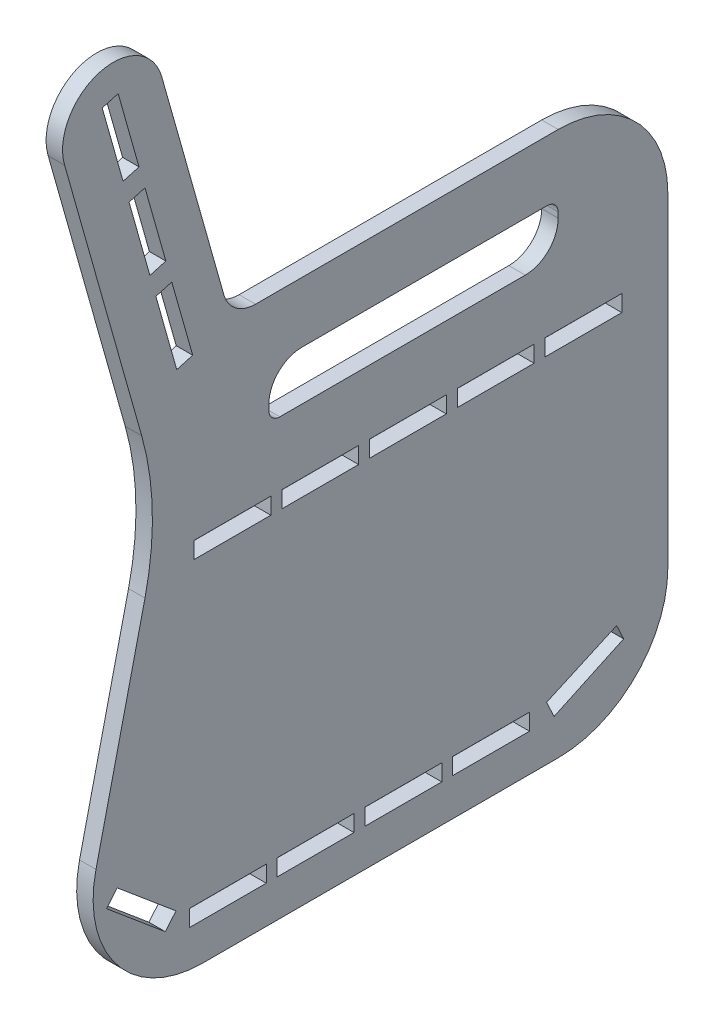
ISO-10303-21;
HEADER;
FILE_DESCRIPTION(('STEP AP214'),'2;1');
FILE_NAME('part.step','',(''),(''),'','','');
FILE_SCHEMA(('AUTOMOTIVE_DESIGN { 1 0 10303 214 1 1 1 1 }'));
ENDSEC;
DATA;
#1=APPLICATION_CONTEXT('core data for automotive mechanical design processes');
#2=APPLICATION_PROTOCOL_DEFINITION('international standard','automotive_design',2000,#1);
#3=PRODUCT_CONTEXT('',#1,'mechanical');
#4=PRODUCT('Part','Part','',(#3));
#5=PRODUCT_RELATED_PRODUCT_CATEGORY('part','',(#4));
#6=PRODUCT_DEFINITION_FORMATION('','',#4);
#7=PRODUCT_DEFINITION_CONTEXT('part definition',#1,'design');
#8=PRODUCT_DEFINITION('design','',#6,#7);
#9=PRODUCT_DEFINITION_SHAPE('','',#8);
#10=(LENGTH_UNIT() NAMED_UNIT(*) SI_UNIT(.MILLI.,.METRE.));
#11=(NAMED_UNIT(*) PLANE_ANGLE_UNIT() SI_UNIT($,.RADIAN.));
#12=(NAMED_UNIT(*) SI_UNIT($,.STERADIAN.) SOLID_ANGLE_UNIT());
#13=UNCERTAINTY_MEASURE_WITH_UNIT(LENGTH_MEASURE(1.E-05),#10,'distance_accuracy_value','');
#14=(GEOMETRIC_REPRESENTATION_CONTEXT(3) GLOBAL_UNCERTAINTY_ASSIGNED_CONTEXT((#13)) GLOBAL_UNIT_ASSIGNED_CONTEXT((#10,
#11,#12)) REPRESENTATION_CONTEXT('',''));
#15=CARTESIAN_POINT('',(0.,0.,0.));
#16=DIRECTION('',(0.,0.,1.));
#17=DIRECTION('',(1.,0.,0.));
#18=AXIS2_PLACEMENT_3D('',#15,#16,#17);
#19=CARTESIAN_POINT('',(-7.5,-3.0427167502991,-267.97046319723));
#20=DIRECTION('',(0.,-1.,0.));
#21=DIRECTION('',(0.,0.,-1.));
#22=AXIS2_PLACEMENT_3D('',#19,#20,#21);
#23=PLANE('',#22);
#24=DIRECTION('',(0.,0.,-1.));
#25=VECTOR('',#24,1.);
#26=CARTESIAN_POINT('',(7.5,-3.0427167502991,-267.97046319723));
#27=LINE('',#26,#25);
#28=CARTESIAN_POINT('',(7.5,-3.0427167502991,-267.97046319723));
#29=VERTEX_POINT('',#28);
#30=CARTESIAN_POINT('',(7.5,-3.0427167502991,-337.97046319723));
#31=VERTEX_POINT('',#30);
#32=EDGE_CURVE('E1078',#29,#31,#27,.T.);
#33=ORIENTED_EDGE('',*,*,#32,.T.);
#34=DIRECTION('',(1.,0.,0.));
#35=VECTOR('',#34,1.);
#36=CARTESIAN_POINT('',(-7.5,-3.0427167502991,-337.97046319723));
#37=LINE('',#36,#35);
#38=CARTESIAN_POINT('',(-7.5,-3.0427167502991,-337.97046319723));
#39=VERTEX_POINT('',#38);
#40=EDGE_CURVE('E11',#39,#31,#37,.T.);
#41=ORIENTED_EDGE('',*,*,#40,.F.);
#42=DIRECTION('',(0.,0.,-1.));
#43=VECTOR('',#42,1.);
#44=CARTESIAN_POINT('',(-7.5,-3.0427167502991,-267.97046319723));
#45=LINE('',#44,#43);
#46=CARTESIAN_POINT('',(-7.5,-3.0427167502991,-267.97046319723));
#47=VERTEX_POINT('',#46);
#48=EDGE_CURVE('E1083',#47,#39,#45,.T.);
#49=ORIENTED_EDGE('',*,*,#48,.F.);
#50=DIRECTION('',(1.,0.,0.));
#51=VECTOR('',#50,1.);
#52=CARTESIAN_POINT('',(-7.5,-3.0427167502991,-267.97046319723));
#53=LINE('',#52,#51);
#54=EDGE_CURVE('E1090',#47,#29,#53,.T.);
#55=ORIENTED_EDGE('',*,*,#54,.T.);
#56=EDGE_LOOP('',(#33,#41,#49,#55));
#57=FACE_BOUND('',#56,.T.);
#58=ADVANCED_FACE('F33',(#57),#23,.F.);
#59=CARTESIAN_POINT('',(-7.5,12.0572832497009,-337.97046319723));
#60=DIRECTION('',(0.,0.,-1.));
#61=DIRECTION('',(-1.,0.,0.));
#62=AXIS2_PLACEMENT_3D('',#59,#60,#61);
#63=PLANE('',#62);
#64=DIRECTION('',(0.,1.,0.));
#65=VECTOR('',#64,1.);
#66=CARTESIAN_POINT('',(7.5,12.0572832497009,-337.97046319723));
#67=LINE('',#66,#65);
#68=CARTESIAN_POINT('',(7.5,12.0572832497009,-337.97046319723));
#69=VERTEX_POINT('',#68);
#70=EDGE_CURVE('E1075',#31,#69,#67,.T.);
#71=ORIENTED_EDGE('',*,*,#70,.T.);
#72=DIRECTION('',(1.,0.,0.));
#73=VECTOR('',#72,1.);
#74=CARTESIAN_POINT('',(-7.5,12.0572832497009,-337.97046319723));
#75=LINE('',#74,#73);
#76=CARTESIAN_POINT('',(-7.5,12.0572832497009,-337.97046319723));
#77=VERTEX_POINT('',#76);
#78=EDGE_CURVE('E40',#77,#69,#75,.T.);
#79=ORIENTED_EDGE('',*,*,#78,.F.);
#80=DIRECTION('',(0.,1.,0.));
#81=VECTOR('',#80,1.);
#82=CARTESIAN_POINT('',(-7.5,12.0572832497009,-337.97046319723));
#83=LINE('',#82,#81);
#84=EDGE_CURVE('E1085',#39,#77,#83,.T.);
#85=ORIENTED_EDGE('',*,*,#84,.F.);
#86=ORIENTED_EDGE('',*,*,#40,.T.);
#87=EDGE_LOOP('',(#71,#79,#85,#86));
#88=FACE_BOUND('',#87,.T.);
#89=ADVANCED_FACE('F1103',(#88),#63,.F.);
#90=CARTESIAN_POINT('',(-7.5,12.0572832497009,-267.97046319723));
#91=DIRECTION('',(0.,1.,0.));
#92=DIRECTION('',(0.,0.,1.));
#93=AXIS2_PLACEMENT_3D('',#90,#91,#92);
#94=PLANE('',#93);
#95=DIRECTION('',(0.,0.,1.));
#96=VECTOR('',#95,1.);
#97=CARTESIAN_POINT('',(7.5,12.0572832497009,-267.97046319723));
#98=LINE('',#97,#96);
#99=CARTESIAN_POINT('',(7.5,12.0572832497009,-267.97046319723));
#100=VERTEX_POINT('',#99);
#101=EDGE_CURVE('E1072',#69,#100,#98,.T.);
#102=ORIENTED_EDGE('',*,*,#101,.T.);
#103=DIRECTION('',(1.,0.,0.));
#104=VECTOR('',#103,1.);
#105=CARTESIAN_POINT('',(-7.5,12.0572832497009,-267.97046319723));
#106=LINE('',#105,#104);
#107=CARTESIAN_POINT('',(-7.5,12.0572832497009,-267.97046319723));
#108=VERTEX_POINT('',#107);
#109=EDGE_CURVE('E1093',#108,#100,#106,.T.);
#110=ORIENTED_EDGE('',*,*,#109,.F.);
#111=DIRECTION('',(0.,0.,1.));
#112=VECTOR('',#111,1.);
#113=CARTESIAN_POINT('',(-7.5,12.0572832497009,-267.97046319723));
#114=LINE('',#113,#112);
#115=EDGE_CURVE('E1087',#77,#108,#114,.T.);
#116=ORIENTED_EDGE('',*,*,#115,.F.);
#117=ORIENTED_EDGE('',*,*,#78,.T.);
#118=EDGE_LOOP('',(#102,#110,#116,#117));
#119=FACE_BOUND('',#118,.T.);
#120=ADVANCED_FACE('F1099',(#119),#94,.F.);
#121=CARTESIAN_POINT('',(-7.5,12.0572832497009,-267.97046319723));
#122=DIRECTION('',(0.,0.,1.));
#123=DIRECTION('',(0.,-1.,0.));
#124=AXIS2_PLACEMENT_3D('',#121,#122,#123);
#125=PLANE('',#124);
#126=DIRECTION('',(0.,-1.,0.));
#127=VECTOR('',#126,1.);
#128=CARTESIAN_POINT('',(7.5,12.0572832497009,-267.97046319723));
#129=LINE('',#128,#127);
#130=EDGE_CURVE('E1070',#100,#29,#129,.T.);
#131=ORIENTED_EDGE('',*,*,#130,.T.);
#132=ORIENTED_EDGE('',*,*,#54,.F.);
#133=DIRECTION('',(0.,-1.,0.));
#134=VECTOR('',#133,1.);
#135=CARTESIAN_POINT('',(-7.5,12.0572832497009,-267.97046319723));
#136=LINE('',#135,#134);
#137=EDGE_CURVE('E1081',#108,#47,#136,.T.);
#138=ORIENTED_EDGE('',*,*,#137,.F.);
#139=ORIENTED_EDGE('',*,*,#109,.T.);
#140=EDGE_LOOP('',(#131,#132,#138,#139));
#141=FACE_BOUND('',#140,.T.);
#142=ADVANCED_FACE('F1112',(#141),#125,.F.);
#143=CARTESIAN_POINT('',(-7.5,-3.0427167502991,-187.97046319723));
#144=DIRECTION('',(0.,-1.,0.));
#145=DIRECTION('',(0.,0.,-1.));
#146=AXIS2_PLACEMENT_3D('',#143,#144,#145);
#147=PLANE('',#146);
#148=DIRECTION('',(0.,0.,-1.));
#149=VECTOR('',#148,1.);
#150=CARTESIAN_POINT('',(7.5,-3.0427167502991,-187.97046319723));
#151=LINE('',#150,#149);
#152=CARTESIAN_POINT('',(7.5,-3.0427167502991,-187.97046319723));
#153=VERTEX_POINT('',#152);
#154=CARTESIAN_POINT('',(7.5,-3.0427167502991,-257.97046319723));
#155=VERTEX_POINT('',#154);
#156=EDGE_CURVE('E1046',#153,#155,#151,.T.);
#157=ORIENTED_EDGE('',*,*,#156,.T.);
#158=DIRECTION('',(1.,0.,0.));
#159=VECTOR('',#158,1.);
#160=CARTESIAN_POINT('',(-7.5,-3.0427167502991,-257.97046319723));
#161=LINE('',#160,#159);
#162=CARTESIAN_POINT('',(-7.5,-3.0427167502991,-257.97046319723));
#163=VERTEX_POINT('',#162);
#164=EDGE_CURVE('E1067',#163,#155,#161,.T.);
#165=ORIENTED_EDGE('',*,*,#164,.F.);
#166=DIRECTION('',(0.,0.,-1.));
#167=VECTOR('',#166,1.);
#168=CARTESIAN_POINT('',(-7.5,-3.0427167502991,-187.97046319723));
#169=LINE('',#168,#167);
#170=CARTESIAN_POINT('',(-7.5,-3.0427167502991,-187.97046319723));
#171=VERTEX_POINT('',#170);
#172=EDGE_CURVE('E1051',#171,#163,#169,.T.);
#173=ORIENTED_EDGE('',*,*,#172,.F.);
#174=DIRECTION('',(1.,0.,0.));
#175=VECTOR('',#174,1.);
#176=CARTESIAN_POINT('',(-7.5,-3.0427167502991,-187.97046319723));
#177=LINE('',#176,#175);
#178=EDGE_CURVE('E1058',#171,#153,#177,.T.);
#179=ORIENTED_EDGE('',*,*,#178,.T.);
#180=EDGE_LOOP('',(#157,#165,#173,#179));
#181=FACE_BOUND('',#180,.T.);
#182=ADVANCED_FACE('F1139',(#181),#147,.F.);
#183=CARTESIAN_POINT('',(-7.5,12.0572832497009,-257.97046319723));
#184=DIRECTION('',(0.,0.,-1.));
#185=DIRECTION('',(-1.,0.,0.));
#186=AXIS2_PLACEMENT_3D('',#183,#184,#185);
#187=PLANE('',#186);
#188=DIRECTION('',(0.,1.,0.));
#189=VECTOR('',#188,1.);
#190=CARTESIAN_POINT('',(7.5,12.0572832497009,-257.97046319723));
#191=LINE('',#190,#189);
#192=CARTESIAN_POINT('',(7.5,12.0572832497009,-257.97046319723));
#193=VERTEX_POINT('',#192);
#194=EDGE_CURVE('E1043',#155,#193,#191,.T.);
#195=ORIENTED_EDGE('',*,*,#194,.T.);
#196=DIRECTION('',(1.,0.,0.));
#197=VECTOR('',#196,1.);
#198=CARTESIAN_POINT('',(-7.5,12.0572832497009,-257.97046319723));
#199=LINE('',#198,#197);
#200=CARTESIAN_POINT('',(-7.5,12.0572832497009,-257.97046319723));
#201=VERTEX_POINT('',#200);
#202=EDGE_CURVE('E1064',#201,#193,#199,.T.);
#203=ORIENTED_EDGE('',*,*,#202,.F.);
#204=DIRECTION('',(0.,1.,0.));
#205=VECTOR('',#204,1.);
#206=CARTESIAN_POINT('',(-7.5,12.0572832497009,-257.97046319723));
#207=LINE('',#206,#205);
#208=EDGE_CURVE('E1053',#163,#201,#207,.T.);
#209=ORIENTED_EDGE('',*,*,#208,.F.);
#210=ORIENTED_EDGE('',*,*,#164,.T.);
#211=EDGE_LOOP('',(#195,#203,#209,#210));
#212=FACE_BOUND('',#211,.T.);
#213=ADVANCED_FACE('F1142',(#212),#187,.F.);
#214=CARTESIAN_POINT('',(-7.5,12.0572832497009,-187.97046319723));
#215=DIRECTION('',(0.,1.,0.));
#216=DIRECTION('',(0.,0.,1.));
#217=AXIS2_PLACEMENT_3D('',#214,#215,#216);
#218=PLANE('',#217);
#219=DIRECTION('',(0.,0.,1.));
#220=VECTOR('',#219,1.);
#221=CARTESIAN_POINT('',(7.5,12.0572832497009,-187.97046319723));
#222=LINE('',#221,#220);
#223=CARTESIAN_POINT('',(7.5,12.0572832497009,-187.97046319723));
#224=VERTEX_POINT('',#223);
#225=EDGE_CURVE('E1040',#193,#224,#222,.T.);
#226=ORIENTED_EDGE('',*,*,#225,.T.);
#227=DIRECTION('',(1.,0.,0.));
#228=VECTOR('',#227,1.);
#229=CARTESIAN_POINT('',(-7.5,12.0572832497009,-187.97046319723));
#230=LINE('',#229,#228);
#231=CARTESIAN_POINT('',(-7.5,12.0572832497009,-187.97046319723));
#232=VERTEX_POINT('',#231);
#233=EDGE_CURVE('E1061',#232,#224,#230,.T.);
#234=ORIENTED_EDGE('',*,*,#233,.F.);
#235=DIRECTION('',(0.,0.,1.));
#236=VECTOR('',#235,1.);
#237=CARTESIAN_POINT('',(-7.5,12.0572832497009,-187.97046319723));
#238=LINE('',#237,#236);
#239=EDGE_CURVE('E1055',#201,#232,#238,.T.);
#240=ORIENTED_EDGE('',*,*,#239,.F.);
#241=ORIENTED_EDGE('',*,*,#202,.T.);
#242=EDGE_LOOP('',(#226,#234,#240,#241));
#243=FACE_BOUND('',#242,.T.);
#244=ADVANCED_FACE('F1146',(#243),#218,.F.);
#245=CARTESIAN_POINT('',(-7.5,12.0572832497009,-187.97046319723));
#246=DIRECTION('',(0.,0.,1.));
#247=DIRECTION('',(0.,-1.,0.));
#248=AXIS2_PLACEMENT_3D('',#245,#246,#247);
#249=PLANE('',#248);
#250=DIRECTION('',(0.,-1.,0.));
#251=VECTOR('',#250,1.);
#252=CARTESIAN_POINT('',(7.5,12.0572832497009,-187.97046319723));
#253=LINE('',#252,#251);
#254=EDGE_CURVE('E1038',#224,#153,#253,.T.);
#255=ORIENTED_EDGE('',*,*,#254,.T.);
#256=ORIENTED_EDGE('',*,*,#178,.F.);
#257=DIRECTION('',(0.,-1.,0.));
#258=VECTOR('',#257,1.);
#259=CARTESIAN_POINT('',(-7.5,12.0572832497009,-187.97046319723));
#260=LINE('',#259,#258);
#261=EDGE_CURVE('E1049',#232,#171,#260,.T.);
#262=ORIENTED_EDGE('',*,*,#261,.F.);
#263=ORIENTED_EDGE('',*,*,#233,.T.);
#264=EDGE_LOOP('',(#255,#256,#262,#263));
#265=FACE_BOUND('',#264,.T.);
#266=ADVANCED_FACE('F1150',(#265),#249,.F.);
#267=CARTESIAN_POINT('',(-7.5,285.461142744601,-352.148374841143));
#268=DIRECTION('',(0.,-1.,0.));
#269=DIRECTION('',(0.,0.,-1.));
#270=AXIS2_PLACEMENT_3D('',#267,#268,#269);
#271=PLANE('',#270);
#272=DIRECTION('',(0.,0.,-1.));
#273=VECTOR('',#272,1.);
#274=CARTESIAN_POINT('',(7.5,285.461142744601,-352.148374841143));
#275=LINE('',#274,#273);
#276=CARTESIAN_POINT('',(7.5,285.461142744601,-352.148374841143));
#277=VERTEX_POINT('',#276);
#278=CARTESIAN_POINT('',(7.5,285.461142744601,-422.148374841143));
#279=VERTEX_POINT('',#278);
#280=EDGE_CURVE('E1014',#277,#279,#275,.T.);
#281=ORIENTED_EDGE('',*,*,#280,.T.);
#282=DIRECTION('',(1.,0.,0.));
#283=VECTOR('',#282,1.);
#284=CARTESIAN_POINT('',(-7.5,285.461142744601,-422.148374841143));
#285=LINE('',#284,#283);
#286=CARTESIAN_POINT('',(-7.5,285.461142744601,-422.148374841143));
#287=VERTEX_POINT('',#286);
#288=EDGE_CURVE('E1035',#287,#279,#285,.T.);
#289=ORIENTED_EDGE('',*,*,#288,.F.);
#290=DIRECTION('',(0.,0.,-1.));
#291=VECTOR('',#290,1.);
#292=CARTESIAN_POINT('',(-7.5,285.461142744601,-352.148374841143));
#293=LINE('',#292,#291);
#294=CARTESIAN_POINT('',(-7.5,285.461142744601,-352.148374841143));
#295=VERTEX_POINT('',#294);
#296=EDGE_CURVE('E1019',#295,#287,#293,.T.);
#297=ORIENTED_EDGE('',*,*,#296,.F.);
#298=DIRECTION('',(1.,0.,0.));
#299=VECTOR('',#298,1.);
#300=CARTESIAN_POINT('',(-7.5,285.461142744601,-352.148374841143));
#301=LINE('',#300,#299);
#302=EDGE_CURVE('E1026',#295,#277,#301,.T.);
#303=ORIENTED_EDGE('',*,*,#302,.T.);
#304=EDGE_LOOP('',(#281,#289,#297,#303));
#305=FACE_BOUND('',#304,.T.);
#306=ADVANCED_FACE('F1154',(#305),#271,.F.);
#307=CARTESIAN_POINT('',(-7.5,300.561142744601,-422.148374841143));
#308=DIRECTION('',(0.,0.,-1.));
#309=DIRECTION('',(-1.,0.,0.));
#310=AXIS2_PLACEMENT_3D('',#307,#308,#309);
#311=PLANE('',#310);
#312=DIRECTION('',(0.,1.,0.));
#313=VECTOR('',#312,1.);
#314=CARTESIAN_POINT('',(7.5,300.561142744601,-422.148374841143));
#315=LINE('',#314,#313);
#316=CARTESIAN_POINT('',(7.5,300.561142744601,-422.148374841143));
#317=VERTEX_POINT('',#316);
#318=EDGE_CURVE('E1011',#279,#317,#315,.T.);
#319=ORIENTED_EDGE('',*,*,#318,.T.);
#320=DIRECTION('',(1.,0.,0.));
#321=VECTOR('',#320,1.);
#322=CARTESIAN_POINT('',(-7.5,300.561142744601,-422.148374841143));
#323=LINE('',#322,#321);
#324=CARTESIAN_POINT('',(-7.5,300.561142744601,-422.148374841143));
#325=VERTEX_POINT('',#324);
#326=EDGE_CURVE('E1032',#325,#317,#323,.T.);
#327=ORIENTED_EDGE('',*,*,#326,.F.);
#328=DIRECTION('',(0.,1.,0.));
#329=VECTOR('',#328,1.);
#330=CARTESIAN_POINT('',(-7.5,300.561142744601,-422.148374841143));
#331=LINE('',#330,#329);
#332=EDGE_CURVE('E1021',#287,#325,#331,.T.);
#333=ORIENTED_EDGE('',*,*,#332,.F.);
#334=ORIENTED_EDGE('',*,*,#288,.T.);
#335=EDGE_LOOP('',(#319,#327,#333,#334));
#336=FACE_BOUND('',#335,.T.);
#337=ADVANCED_FACE('F1158',(#336),#311,.F.);
#338=CARTESIAN_POINT('',(-7.5,300.561142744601,-352.148374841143));
#339=DIRECTION('',(0.,1.,0.));
#340=DIRECTION('',(0.,0.,1.));
#341=AXIS2_PLACEMENT_3D('',#338,#339,#340);
#342=PLANE('',#341);
#343=DIRECTION('',(0.,0.,1.));
#344=VECTOR('',#343,1.);
#345=CARTESIAN_POINT('',(7.5,300.561142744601,-352.148374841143));
#346=LINE('',#345,#344);
#347=CARTESIAN_POINT('',(7.5,300.561142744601,-352.148374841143));
#348=VERTEX_POINT('',#347);
#349=EDGE_CURVE('E1008',#317,#348,#346,.T.);
#350=ORIENTED_EDGE('',*,*,#349,.T.);
#351=DIRECTION('',(1.,0.,0.));
#352=VECTOR('',#351,1.);
#353=CARTESIAN_POINT('',(-7.5,300.561142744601,-352.148374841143));
#354=LINE('',#353,#352);
#355=CARTESIAN_POINT('',(-7.5,300.561142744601,-352.148374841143));
#356=VERTEX_POINT('',#355);
#357=EDGE_CURVE('E1029',#356,#348,#354,.T.);
#358=ORIENTED_EDGE('',*,*,#357,.F.);
#359=DIRECTION('',(0.,0.,1.));
#360=VECTOR('',#359,1.);
#361=CARTESIAN_POINT('',(-7.5,300.561142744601,-352.148374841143));
#362=LINE('',#361,#360);
#363=EDGE_CURVE('E1023',#325,#356,#362,.T.);
#364=ORIENTED_EDGE('',*,*,#363,.F.);
#365=ORIENTED_EDGE('',*,*,#326,.T.);
#366=EDGE_LOOP('',(#350,#358,#364,#365));
#367=FACE_BOUND('',#366,.T.);
#368=ADVANCED_FACE('F1162',(#367),#342,.F.);
#369=CARTESIAN_POINT('',(-7.5,300.561142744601,-352.148374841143));
#370=DIRECTION('',(0.,0.,1.));
#371=DIRECTION('',(1.,0.,0.));
#372=AXIS2_PLACEMENT_3D('',#369,#370,#371);
#373=PLANE('',#372);
#374=DIRECTION('',(0.,-1.,0.));
#375=VECTOR('',#374,1.);
#376=CARTESIAN_POINT('',(7.5,300.561142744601,-352.148374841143));
#377=LINE('',#376,#375);
#378=EDGE_CURVE('E1006',#348,#277,#377,.T.);
#379=ORIENTED_EDGE('',*,*,#378,.T.);
#380=ORIENTED_EDGE('',*,*,#302,.F.);
#381=DIRECTION('',(0.,-1.,0.));
#382=VECTOR('',#381,1.);
#383=CARTESIAN_POINT('',(-7.5,300.561142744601,-352.148374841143));
#384=LINE('',#383,#382);
#385=EDGE_CURVE('E1017',#356,#295,#384,.T.);
#386=ORIENTED_EDGE('',*,*,#385,.F.);
#387=ORIENTED_EDGE('',*,*,#357,.T.);
#388=EDGE_LOOP('',(#379,#380,#386,#387));
#389=FACE_BOUND('',#388,.T.);
#390=ADVANCED_FACE('F1166',(#389),#373,.F.);
#391=CARTESIAN_POINT('',(-7.5,285.461142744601,-272.148374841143));
#392=DIRECTION('',(0.,-1.,0.));
#393=DIRECTION('',(0.,0.,-1.));
#394=AXIS2_PLACEMENT_3D('',#391,#392,#393);
#395=PLANE('',#394);
#396=DIRECTION('',(0.,0.,-1.));
#397=VECTOR('',#396,1.);
#398=CARTESIAN_POINT('',(7.5,285.461142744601,-272.148374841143));
#399=LINE('',#398,#397);
#400=CARTESIAN_POINT('',(7.5,285.461142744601,-272.148374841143));
#401=VERTEX_POINT('',#400);
#402=CARTESIAN_POINT('',(7.5,285.461142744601,-342.148374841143));
#403=VERTEX_POINT('',#402);
#404=EDGE_CURVE('E982',#401,#403,#399,.T.);
#405=ORIENTED_EDGE('',*,*,#404,.T.);
#406=DIRECTION('',(1.,0.,0.));
#407=VECTOR('',#406,1.);
#408=CARTESIAN_POINT('',(-7.5,285.461142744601,-342.148374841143));
#409=LINE('',#408,#407);
#410=CARTESIAN_POINT('',(-7.5,285.461142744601,-342.148374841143));
#411=VERTEX_POINT('',#410);
#412=EDGE_CURVE('E1003',#411,#403,#409,.T.);
#413=ORIENTED_EDGE('',*,*,#412,.F.);
#414=DIRECTION('',(0.,0.,-1.));
#415=VECTOR('',#414,1.);
#416=CARTESIAN_POINT('',(-7.5,285.461142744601,-272.148374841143));
#417=LINE('',#416,#415);
#418=CARTESIAN_POINT('',(-7.5,285.461142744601,-272.148374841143));
#419=VERTEX_POINT('',#418);
#420=EDGE_CURVE('E987',#419,#411,#417,.T.);
#421=ORIENTED_EDGE('',*,*,#420,.F.);
#422=DIRECTION('',(1.,0.,0.));
#423=VECTOR('',#422,1.);
#424=CARTESIAN_POINT('',(-7.5,285.461142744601,-272.148374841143));
#425=LINE('',#424,#423);
#426=EDGE_CURVE('E994',#419,#401,#425,.T.);
#427=ORIENTED_EDGE('',*,*,#426,.T.);
#428=EDGE_LOOP('',(#405,#413,#421,#427));
#429=FACE_BOUND('',#428,.T.);
#430=ADVANCED_FACE('F1170',(#429),#395,.F.);
#431=CARTESIAN_POINT('',(-7.5,300.561142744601,-342.148374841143));
#432=DIRECTION('',(0.,0.,-1.));
#433=DIRECTION('',(-1.,0.,0.));
#434=AXIS2_PLACEMENT_3D('',#431,#432,#433);
#435=PLANE('',#434);
#436=DIRECTION('',(0.,1.,0.));
#437=VECTOR('',#436,1.);
#438=CARTESIAN_POINT('',(7.5,300.561142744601,-342.148374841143));
#439=LINE('',#438,#437);
#440=CARTESIAN_POINT('',(7.5,300.561142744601,-342.148374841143));
#441=VERTEX_POINT('',#440);
#442=EDGE_CURVE('E979',#403,#441,#439,.T.);
#443=ORIENTED_EDGE('',*,*,#442,.T.);
#444=DIRECTION('',(1.,0.,0.));
#445=VECTOR('',#444,1.);
#446=CARTESIAN_POINT('',(-7.5,300.561142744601,-342.148374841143));
#447=LINE('',#446,#445);
#448=CARTESIAN_POINT('',(-7.5,300.561142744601,-342.148374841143));
#449=VERTEX_POINT('',#448);
#450=EDGE_CURVE('E1000',#449,#441,#447,.T.);
#451=ORIENTED_EDGE('',*,*,#450,.F.);
#452=DIRECTION('',(0.,1.,0.));
#453=VECTOR('',#452,1.);
#454=CARTESIAN_POINT('',(-7.5,300.561142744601,-342.148374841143));
#455=LINE('',#454,#453);
#456=EDGE_CURVE('E989',#411,#449,#455,.T.);
#457=ORIENTED_EDGE('',*,*,#456,.F.);
#458=ORIENTED_EDGE('',*,*,#412,.T.);
#459=EDGE_LOOP('',(#443,#451,#457,#458));
#460=FACE_BOUND('',#459,.T.);
#461=ADVANCED_FACE('F1174',(#460),#435,.F.);
#462=CARTESIAN_POINT('',(-7.5,300.561142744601,-272.148374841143));
#463=DIRECTION('',(0.,1.,0.));
#464=DIRECTION('',(0.,0.,1.));
#465=AXIS2_PLACEMENT_3D('',#462,#463,#464);
#466=PLANE('',#465);
#467=DIRECTION('',(0.,0.,1.));
#468=VECTOR('',#467,1.);
#469=CARTESIAN_POINT('',(7.5,300.561142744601,-272.148374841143));
#470=LINE('',#469,#468);
#471=CARTESIAN_POINT('',(7.5,300.561142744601,-272.148374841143));
#472=VERTEX_POINT('',#471);
#473=EDGE_CURVE('E976',#441,#472,#470,.T.);
#474=ORIENTED_EDGE('',*,*,#473,.T.);
#475=DIRECTION('',(1.,0.,0.));
#476=VECTOR('',#475,1.);
#477=CARTESIAN_POINT('',(-7.5,300.561142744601,-272.148374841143));
#478=LINE('',#477,#476);
#479=CARTESIAN_POINT('',(-7.5,300.561142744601,-272.148374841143));
#480=VERTEX_POINT('',#479);
#481=EDGE_CURVE('E997',#480,#472,#478,.T.);
#482=ORIENTED_EDGE('',*,*,#481,.F.);
#483=DIRECTION('',(0.,0.,1.));
#484=VECTOR('',#483,1.);
#485=CARTESIAN_POINT('',(-7.5,300.561142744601,-272.148374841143));
#486=LINE('',#485,#484);
#487=EDGE_CURVE('E991',#449,#480,#486,.T.);
#488=ORIENTED_EDGE('',*,*,#487,.F.);
#489=ORIENTED_EDGE('',*,*,#450,.T.);
#490=EDGE_LOOP('',(#474,#482,#488,#489));
#491=FACE_BOUND('',#490,.T.);
#492=ADVANCED_FACE('F1178',(#491),#466,.F.);
#493=CARTESIAN_POINT('',(-7.5,300.561142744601,-272.148374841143));
#494=DIRECTION('',(0.,0.,1.));
#495=DIRECTION('',(1.,0.,0.));
#496=AXIS2_PLACEMENT_3D('',#493,#494,#495);
#497=PLANE('',#496);
#498=DIRECTION('',(0.,-1.,0.));
#499=VECTOR('',#498,1.);
#500=CARTESIAN_POINT('',(7.5,300.561142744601,-272.148374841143));
#501=LINE('',#500,#499);
#502=EDGE_CURVE('E974',#472,#401,#501,.T.);
#503=ORIENTED_EDGE('',*,*,#502,.T.);
#504=ORIENTED_EDGE('',*,*,#426,.F.);
#505=DIRECTION('',(0.,-1.,0.));
#506=VECTOR('',#505,1.);
#507=CARTESIAN_POINT('',(-7.5,300.561142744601,-272.148374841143));
#508=LINE('',#507,#506);
#509=EDGE_CURVE('E985',#480,#419,#508,.T.);
#510=ORIENTED_EDGE('',*,*,#509,.F.);
#511=ORIENTED_EDGE('',*,*,#481,.T.);
#512=EDGE_LOOP('',(#503,#504,#510,#511));
#513=FACE_BOUND('',#512,.T.);
#514=ADVANCED_FACE('F1182',(#513),#497,.F.);
#515=CARTESIAN_POINT('',(-7.5,285.461142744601,-192.148374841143));
#516=DIRECTION('',(0.,-1.,0.));
#517=DIRECTION('',(0.,0.,-1.));
#518=AXIS2_PLACEMENT_3D('',#515,#516,#517);
#519=PLANE('',#518);
#520=DIRECTION('',(0.,0.,-1.));
#521=VECTOR('',#520,1.);
#522=CARTESIAN_POINT('',(7.5,285.461142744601,-192.148374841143));
#523=LINE('',#522,#521);
#524=CARTESIAN_POINT('',(7.5,285.461142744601,-192.148374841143));
#525=VERTEX_POINT('',#524);
#526=CARTESIAN_POINT('',(7.5,285.461142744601,-262.148374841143));
#527=VERTEX_POINT('',#526);
#528=EDGE_CURVE('E950',#525,#527,#523,.T.);
#529=ORIENTED_EDGE('',*,*,#528,.T.);
#530=DIRECTION('',(1.,0.,0.));
#531=VECTOR('',#530,1.);
#532=CARTESIAN_POINT('',(-7.5,285.461142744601,-262.148374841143));
#533=LINE('',#532,#531);
#534=CARTESIAN_POINT('',(-7.5,285.461142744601,-262.148374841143));
#535=VERTEX_POINT('',#534);
#536=EDGE_CURVE('E971',#535,#527,#533,.T.);
#537=ORIENTED_EDGE('',*,*,#536,.F.);
#538=DIRECTION('',(0.,0.,-1.));
#539=VECTOR('',#538,1.);
#540=CARTESIAN_POINT('',(-7.5,285.461142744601,-192.148374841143));
#541=LINE('',#540,#539);
#542=CARTESIAN_POINT('',(-7.5,285.461142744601,-192.148374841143));
#543=VERTEX_POINT('',#542);
#544=EDGE_CURVE('E955',#543,#535,#541,.T.);
#545=ORIENTED_EDGE('',*,*,#544,.F.);
#546=DIRECTION('',(1.,0.,0.));
#547=VECTOR('',#546,1.);
#548=CARTESIAN_POINT('',(-7.5,285.461142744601,-192.148374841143));
#549=LINE('',#548,#547);
#550=EDGE_CURVE('E962',#543,#525,#549,.T.);
#551=ORIENTED_EDGE('',*,*,#550,.T.);
#552=EDGE_LOOP('',(#529,#537,#545,#551));
#553=FACE_BOUND('',#552,.T.);
#554=ADVANCED_FACE('F1186',(#553),#519,.F.);
#555=CARTESIAN_POINT('',(-7.5,300.561142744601,-262.148374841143));
#556=DIRECTION('',(0.,0.,-1.));
#557=DIRECTION('',(-1.,0.,0.));
#558=AXIS2_PLACEMENT_3D('',#555,#556,#557);
#559=PLANE('',#558);
#560=DIRECTION('',(0.,1.,0.));
#561=VECTOR('',#560,1.);
#562=CARTESIAN_POINT('',(7.5,300.561142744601,-262.148374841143));
#563=LINE('',#562,#561);
#564=CARTESIAN_POINT('',(7.5,300.561142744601,-262.148374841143));
#565=VERTEX_POINT('',#564);
#566=EDGE_CURVE('E947',#527,#565,#563,.T.);
#567=ORIENTED_EDGE('',*,*,#566,.T.);
#568=DIRECTION('',(1.,0.,0.));
#569=VECTOR('',#568,1.);
#570=CARTESIAN_POINT('',(-7.5,300.561142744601,-262.148374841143));
#571=LINE('',#570,#569);
#572=CARTESIAN_POINT('',(-7.5,300.561142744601,-262.148374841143));
#573=VERTEX_POINT('',#572);
#574=EDGE_CURVE('E968',#573,#565,#571,.T.);
#575=ORIENTED_EDGE('',*,*,#574,.F.);
#576=DIRECTION('',(0.,1.,0.));
#577=VECTOR('',#576,1.);
#578=CARTESIAN_POINT('',(-7.5,300.561142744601,-262.148374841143));
#579=LINE('',#578,#577);
#580=EDGE_CURVE('E957',#535,#573,#579,.T.);
#581=ORIENTED_EDGE('',*,*,#580,.F.);
#582=ORIENTED_EDGE('',*,*,#536,.T.);
#583=EDGE_LOOP('',(#567,#575,#581,#582));
#584=FACE_BOUND('',#583,.T.);
#585=ADVANCED_FACE('F1190',(#584),#559,.F.);
#586=CARTESIAN_POINT('',(-7.5,300.561142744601,-192.148374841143));
#587=DIRECTION('',(0.,1.,0.));
#588=DIRECTION('',(0.,0.,1.));
#589=AXIS2_PLACEMENT_3D('',#586,#587,#588);
#590=PLANE('',#589);
#591=DIRECTION('',(0.,0.,1.));
#592=VECTOR('',#591,1.);
#593=CARTESIAN_POINT('',(7.5,300.561142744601,-192.148374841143));
#594=LINE('',#593,#592);
#595=CARTESIAN_POINT('',(7.5,300.561142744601,-192.148374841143));
#596=VERTEX_POINT('',#595);
#597=EDGE_CURVE('E944',#565,#596,#594,.T.);
#598=ORIENTED_EDGE('',*,*,#597,.T.);
#599=DIRECTION('',(1.,0.,0.));
#600=VECTOR('',#599,1.);
#601=CARTESIAN_POINT('',(-7.5,300.561142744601,-192.148374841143));
#602=LINE('',#601,#600);
#603=CARTESIAN_POINT('',(-7.5,300.561142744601,-192.148374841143));
#604=VERTEX_POINT('',#603);
#605=EDGE_CURVE('E965',#604,#596,#602,.T.);
#606=ORIENTED_EDGE('',*,*,#605,.F.);
#607=DIRECTION('',(0.,0.,1.));
#608=VECTOR('',#607,1.);
#609=CARTESIAN_POINT('',(-7.5,300.561142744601,-192.148374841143));
#610=LINE('',#609,#608);
#611=EDGE_CURVE('E959',#573,#604,#610,.T.);
#612=ORIENTED_EDGE('',*,*,#611,.F.);
#613=ORIENTED_EDGE('',*,*,#574,.T.);
#614=EDGE_LOOP('',(#598,#606,#612,#613));
#615=FACE_BOUND('',#614,.T.);
#616=ADVANCED_FACE('F1194',(#615),#590,.F.);
#617=CARTESIAN_POINT('',(-7.5,300.561142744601,-192.148374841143));
#618=DIRECTION('',(0.,0.,1.));
#619=DIRECTION('',(1.,0.,0.));
#620=AXIS2_PLACEMENT_3D('',#617,#618,#619);
#621=PLANE('',#620);
#622=DIRECTION('',(0.,-1.,0.));
#623=VECTOR('',#622,1.);
#624=CARTESIAN_POINT('',(7.5,300.561142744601,-192.148374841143));
#625=LINE('',#624,#623);
#626=EDGE_CURVE('E942',#596,#525,#625,.T.);
#627=ORIENTED_EDGE('',*,*,#626,.T.);
#628=ORIENTED_EDGE('',*,*,#550,.F.);
#629=DIRECTION('',(0.,-1.,0.));
#630=VECTOR('',#629,1.);
#631=CARTESIAN_POINT('',(-7.5,300.561142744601,-192.148374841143));
#632=LINE('',#631,#630);
#633=EDGE_CURVE('E953',#604,#543,#632,.T.);
#634=ORIENTED_EDGE('',*,*,#633,.F.);
#635=ORIENTED_EDGE('',*,*,#605,.T.);
#636=EDGE_LOOP('',(#627,#628,#634,#635));
#637=FACE_BOUND('',#636,.T.);
#638=ADVANCED_FACE('F1124',(#637),#621,.F.);
#639=CARTESIAN_POINT('',(7.5,668.877321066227,41.6838199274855));
#640=DIRECTION('',(1.,0.,0.));
#641=DIRECTION('',(0.,0.,-1.));
#642=AXIS2_PLACEMENT_3D('',#639,#640,#641);
#643=PLANE('',#642);
#644=DIRECTION('',(0.,-0.906307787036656,-0.422618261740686));
#645=VECTOR('',#644,1.);
#646=CARTESIAN_POINT('',(7.5,11.9973784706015,-353.55832524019));
#647=LINE('',#646,#645);
#648=CARTESIAN_POINT('',(7.5,11.9973784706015,-353.55832524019));
#649=VERTEX_POINT('',#648);
#650=CARTESIAN_POINT('',(7.5,-2.59417690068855,-360.362479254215));
#651=VERTEX_POINT('',#650);
#652=EDGE_CURVE('E47',#649,#651,#647,.T.);
#653=ORIENTED_EDGE('',*,*,#652,.F.);
#654=DIRECTION('',(0.,-0.409627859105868,0.912252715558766));
#655=VECTOR('',#654,1.);
#656=CARTESIAN_POINT('',(7.5,11.9973784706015,-353.55832524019));
#657=LINE('',#656,#655);
#658=CARTESIAN_POINT('',(7.5,40.6713286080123,-417.416015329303));
#659=VERTEX_POINT('',#658);
#660=EDGE_CURVE('E523',#659,#649,#657,.T.);
#661=ORIENTED_EDGE('',*,*,#660,.F.);
#662=DIRECTION('',(0.,0.906107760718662,0.423046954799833));
#663=VECTOR('',#662,1.);
#664=CARTESIAN_POINT('',(7.5,40.6713286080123,-417.416015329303));
#665=LINE('',#664,#663);
#666=CARTESIAN_POINT('',(7.5,26.9891014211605,-423.804024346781));
#667=VERTEX_POINT('',#666);
#668=EDGE_CURVE('E526',#667,#659,#665,.T.);
#669=ORIENTED_EDGE('',*,*,#668,.F.);
#670=DIRECTION('',(0.,0.422618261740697,-0.906307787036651));
#671=VECTOR('',#670,1.);
#672=CARTESIAN_POINT('',(7.5,-2.59417690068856,-360.362479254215));
#673=LINE('',#672,#671);
#674=EDGE_CURVE('E532',#651,#667,#673,.T.);
#675=ORIENTED_EDGE('',*,*,#674,.F.);
#676=EDGE_LOOP('',(#653,#661,#669,#675));
#677=FACE_BOUND('',#676,.T.);
#678=DIRECTION('',(0.,-0.766044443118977,0.642787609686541));
#679=VECTOR('',#678,1.);
#680=CARTESIAN_POINT('',(7.5,61.2688662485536,37.9817052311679));
#681=LINE('',#680,#679);
#682=CARTESIAN_POINT('',(7.5,61.2688662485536,37.9817052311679));
#683=VERTEX_POINT('',#682);
#684=CARTESIAN_POINT('',(7.5,49.7015951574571,47.6877981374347));
#685=VERTEX_POINT('',#684);
#686=EDGE_CURVE('E538',#683,#685,#681,.T.);
#687=ORIENTED_EDGE('',*,*,#686,.F.);
#688=DIRECTION('',(0.,0.64278760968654,0.766044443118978));
#689=VECTOR('',#688,1.);
#690=CARTESIAN_POINT('',(7.5,61.2688662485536,37.9817052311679));
#691=LINE('',#690,#689);
#692=CARTESIAN_POINT('',(7.5,16.2737335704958,-15.6414057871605));
#693=VERTEX_POINT('',#692);
#694=EDGE_CURVE('E546',#693,#683,#691,.T.);
#695=ORIENTED_EDGE('',*,*,#694,.F.);
#696=DIRECTION('',(0.,0.766044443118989,-0.642787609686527));
#697=VECTOR('',#696,1.);
#698=CARTESIAN_POINT('',(7.5,16.2737335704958,-15.6414057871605));
#699=LINE('',#698,#697);
#700=CARTESIAN_POINT('',(7.5,4.70646247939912,-5.93531288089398));
#701=VERTEX_POINT('',#700);
#702=EDGE_CURVE('E560',#701,#693,#699,.T.);
#703=ORIENTED_EDGE('',*,*,#702,.F.);
#704=DIRECTION('',(0.,-0.642787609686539,-0.766044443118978));
#705=VECTOR('',#704,1.);
#706=CARTESIAN_POINT('',(7.5,49.7015951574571,47.6877981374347));
#707=LINE('',#706,#705);
#708=EDGE_CURVE('E557',#685,#701,#707,.T.);
#709=ORIENTED_EDGE('',*,*,#708,.F.);
#710=EDGE_LOOP('',(#687,#695,#703,#709));
#711=FACE_BOUND('',#710,.T.);
#712=DIRECTION('',(0.,-1.,0.));
#713=VECTOR('',#712,1.);
#714=CARTESIAN_POINT('',(7.5,12.0572832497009,-107.97046319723));
#715=LINE('',#714,#713);
#716=CARTESIAN_POINT('',(7.5,12.0572832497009,-107.97046319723));
#717=VERTEX_POINT('',#716);
#718=CARTESIAN_POINT('',(7.5,-3.0427167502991,-107.97046319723));
#719=VERTEX_POINT('',#718);
#720=EDGE_CURVE('E600',#717,#719,#715,.T.);
#721=ORIENTED_EDGE('',*,*,#720,.F.);
#722=DIRECTION('',(0.,0.,1.));
#723=VECTOR('',#722,1.);
#724=CARTESIAN_POINT('',(7.5,12.0572832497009,-107.97046319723));
#725=LINE('',#724,#723);
#726=CARTESIAN_POINT('',(7.5,12.0572832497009,-177.97046319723));
#727=VERTEX_POINT('',#726);
#728=EDGE_CURVE('E592',#727,#717,#725,.T.);
#729=ORIENTED_EDGE('',*,*,#728,.F.);
#730=DIRECTION('',(0.,1.,0.));
#731=VECTOR('',#730,1.);
#732=CARTESIAN_POINT('',(7.5,12.0572832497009,-177.97046319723));
#733=LINE('',#732,#731);
#734=CARTESIAN_POINT('',(7.5,-3.0427167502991,-177.97046319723));
#735=VERTEX_POINT('',#734);
#736=EDGE_CURVE('E584',#735,#727,#733,.T.);
#737=ORIENTED_EDGE('',*,*,#736,.F.);
#738=DIRECTION('',(0.,0.,-1.));
#739=VECTOR('',#738,1.);
#740=CARTESIAN_POINT('',(7.5,-3.0427167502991,-107.97046319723));
#741=LINE('',#740,#739);
#742=EDGE_CURVE('E567',#719,#735,#741,.T.);
#743=ORIENTED_EDGE('',*,*,#742,.F.);
#744=EDGE_LOOP('',(#721,#729,#737,#743));
#745=FACE_BOUND('',#744,.T.);
#746=DIRECTION('',(0.,-1.,0.));
#747=VECTOR('',#746,1.);
#748=CARTESIAN_POINT('',(7.5,12.0572832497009,-27.9704631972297));
#749=LINE('',#748,#747);
#750=CARTESIAN_POINT('',(7.5,12.0572832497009,-27.9704631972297));
#751=VERTEX_POINT('',#750);
#752=CARTESIAN_POINT('',(7.5,-3.0427167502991,-27.9704631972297));
#753=VERTEX_POINT('',#752);
#754=EDGE_CURVE('E605',#751,#753,#749,.T.);
#755=ORIENTED_EDGE('',*,*,#754,.F.);
#756=DIRECTION('',(0.,0.,1.));
#757=VECTOR('',#756,1.);
#758=CARTESIAN_POINT('',(7.5,12.0572832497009,-27.9704631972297));
#759=LINE('',#758,#757);
#760=CARTESIAN_POINT('',(7.5,12.0572832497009,-97.9704631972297));
#761=VERTEX_POINT('',#760);
#762=EDGE_CURVE('E610',#761,#751,#759,.T.);
#763=ORIENTED_EDGE('',*,*,#762,.F.);
#764=DIRECTION('',(0.,1.,0.));
#765=VECTOR('',#764,1.);
#766=CARTESIAN_POINT('',(7.5,12.0572832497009,-97.9704631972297));
#767=LINE('',#766,#765);
#768=CARTESIAN_POINT('',(7.5,-3.0427167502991,-97.9704631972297));
#769=VERTEX_POINT('',#768);
#770=EDGE_CURVE('E624',#769,#761,#767,.T.);
#771=ORIENTED_EDGE('',*,*,#770,.F.);
#772=DIRECTION('',(0.,0.,-1.));
#773=VECTOR('',#772,1.);
#774=CARTESIAN_POINT('',(7.5,-3.0427167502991,-27.9704631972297));
#775=LINE('',#774,#773);
#776=EDGE_CURVE('E621',#753,#769,#775,.T.);
#777=ORIENTED_EDGE('',*,*,#776,.F.);
#778=EDGE_LOOP('',(#755,#763,#771,#777));
#779=FACE_BOUND('',#778,.T.);
#780=DIRECTION('',(0.,-1.,0.));
#781=VECTOR('',#780,1.);
#782=CARTESIAN_POINT('',(7.5,300.561142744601,-112.148374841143));
#783=LINE('',#782,#781);
#784=CARTESIAN_POINT('',(7.5,300.561142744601,-112.148374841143));
#785=VERTEX_POINT('',#784);
#786=CARTESIAN_POINT('',(7.5,285.461142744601,-112.148374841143));
#787=VERTEX_POINT('',#786);
#788=EDGE_CURVE('E664',#785,#787,#783,.T.);
#789=ORIENTED_EDGE('',*,*,#788,.F.);
#790=DIRECTION('',(0.,0.,1.));
#791=VECTOR('',#790,1.);
#792=CARTESIAN_POINT('',(7.5,300.561142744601,-112.148374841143));
#793=LINE('',#792,#791);
#794=CARTESIAN_POINT('',(7.5,300.561142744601,-182.148374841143));
#795=VERTEX_POINT('',#794);
#796=EDGE_CURVE('E656',#795,#785,#793,.T.);
#797=ORIENTED_EDGE('',*,*,#796,.F.);
#798=DIRECTION('',(0.,1.,0.));
#799=VECTOR('',#798,1.);
#800=CARTESIAN_POINT('',(7.5,300.561142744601,-182.148374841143));
#801=LINE('',#800,#799);
#802=CARTESIAN_POINT('',(7.5,285.461142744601,-182.148374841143));
#803=VERTEX_POINT('',#802);
#804=EDGE_CURVE('E648',#803,#795,#801,.T.);
#805=ORIENTED_EDGE('',*,*,#804,.F.);
#806=DIRECTION('',(0.,0.,-1.));
#807=VECTOR('',#806,1.);
#808=CARTESIAN_POINT('',(7.5,285.461142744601,-112.148374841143));
#809=LINE('',#808,#807);
#810=EDGE_CURVE('E631',#787,#803,#809,.T.);
#811=ORIENTED_EDGE('',*,*,#810,.F.);
#812=EDGE_LOOP('',(#789,#797,#805,#811));
#813=FACE_BOUND('',#812,.T.);
#814=DIRECTION('',(0.,-1.,0.));
#815=VECTOR('',#814,1.);
#816=CARTESIAN_POINT('',(7.5,300.561142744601,-32.1483748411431));
#817=LINE('',#816,#815);
#818=CARTESIAN_POINT('',(7.5,300.561142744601,-32.1483748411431));
#819=VERTEX_POINT('',#818);
#820=CARTESIAN_POINT('',(7.5,285.461142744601,-32.1483748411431));
#821=VERTEX_POINT('',#820);
#822=EDGE_CURVE('E669',#819,#821,#817,.T.);
#823=ORIENTED_EDGE('',*,*,#822,.F.);
#824=DIRECTION('',(0.,0.,1.));
#825=VECTOR('',#824,1.);
#826=CARTESIAN_POINT('',(7.5,300.561142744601,-32.1483748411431));
#827=LINE('',#826,#825);
#828=CARTESIAN_POINT('',(7.5,300.561142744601,-102.148374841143));
#829=VERTEX_POINT('',#828);
#830=EDGE_CURVE('E674',#829,#819,#827,.T.);
#831=ORIENTED_EDGE('',*,*,#830,.F.);
#832=DIRECTION('',(0.,1.,0.));
#833=VECTOR('',#832,1.);
#834=CARTESIAN_POINT('',(7.5,300.561142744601,-102.148374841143));
#835=LINE('',#834,#833);
#836=CARTESIAN_POINT('',(7.5,285.461142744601,-102.148374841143));
#837=VERTEX_POINT('',#836);
#838=EDGE_CURVE('E688',#837,#829,#835,.T.);
#839=ORIENTED_EDGE('',*,*,#838,.F.);
#840=DIRECTION('',(0.,0.,-1.));
#841=VECTOR('',#840,1.);
#842=CARTESIAN_POINT('',(7.5,285.461142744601,-32.1483748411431));
#843=LINE('',#842,#841);
#844=EDGE_CURVE('E685',#821,#837,#843,.T.);
#845=ORIENTED_EDGE('',*,*,#844,.F.);
#846=EDGE_LOOP('',(#823,#831,#839,#845));
#847=FACE_BOUND('',#846,.T.);
#848=DIRECTION('',(0.,0.271808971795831,-0.962351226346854));
#849=VECTOR('',#848,1.);
#850=CARTESIAN_POINT('',(7.5,443.331114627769,-16.3251717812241));
#851=LINE('',#850,#849);
#852=CARTESIAN_POINT('',(7.5,443.331114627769,-16.3251717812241));
#853=VERTEX_POINT('',#852);
#854=CARTESIAN_POINT('',(7.5,447.435430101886,-30.8566752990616));
#855=VERTEX_POINT('',#854);
#856=EDGE_CURVE('E695',#853,#855,#851,.T.);
#857=ORIENTED_EDGE('',*,*,#856,.F.);
#858=DIRECTION('',(0.,-0.962351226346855,-0.271808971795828));
#859=VECTOR('',#858,1.);
#860=CARTESIAN_POINT('',(7.5,443.331114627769,-16.3251717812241));
#861=LINE('',#860,#859);
#862=CARTESIAN_POINT('',(7.5,510.695700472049,2.70145624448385));
#863=VERTEX_POINT('',#862);
#864=EDGE_CURVE('E706',#863,#853,#861,.T.);
#865=ORIENTED_EDGE('',*,*,#864,.F.);
#866=DIRECTION('',(0.,-0.271808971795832,0.962351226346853));
#867=VECTOR('',#866,1.);
#868=CARTESIAN_POINT('',(7.5,510.695700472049,2.70145624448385));
#869=LINE('',#868,#867);
#870=CARTESIAN_POINT('',(7.5,514.800015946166,-11.8300472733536));
#871=VERTEX_POINT('',#870);
#872=EDGE_CURVE('E720',#871,#863,#869,.T.);
#873=ORIENTED_EDGE('',*,*,#872,.F.);
#874=DIRECTION('',(0.,0.962351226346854,0.271808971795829));
#875=VECTOR('',#874,1.);
#876=CARTESIAN_POINT('',(7.5,447.435430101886,-30.8566752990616));
#877=LINE('',#876,#875);
#878=EDGE_CURVE('E717',#855,#871,#877,.T.);
#879=ORIENTED_EDGE('',*,*,#878,.F.);
#880=EDGE_LOOP('',(#857,#865,#873,#879));
#881=FACE_BOUND('',#880,.T.);
#882=DIRECTION('',(0.,0.271808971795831,-0.962351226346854));
#883=VECTOR('',#882,1.);
#884=CARTESIAN_POINT('',(7.5,529.942724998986,8.1376356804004));
#885=LINE('',#884,#883);
#886=CARTESIAN_POINT('',(7.5,529.942724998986,8.1376356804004));
#887=VERTEX_POINT('',#886);
#888=CARTESIAN_POINT('',(7.5,534.047040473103,-6.39386783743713));
#889=VERTEX_POINT('',#888);
#890=EDGE_CURVE('E727',#887,#889,#885,.T.);
#891=ORIENTED_EDGE('',*,*,#890,.F.);
#892=DIRECTION('',(0.,-0.962351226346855,-0.271808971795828));
#893=VECTOR('',#892,1.);
#894=CARTESIAN_POINT('',(7.5,529.942724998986,8.1376356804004));
#895=LINE('',#894,#893);
#896=CARTESIAN_POINT('',(7.5,597.307310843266,27.1642637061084));
#897=VERTEX_POINT('',#896);
#898=EDGE_CURVE('E738',#897,#887,#895,.T.);
#899=ORIENTED_EDGE('',*,*,#898,.F.);
#900=DIRECTION('',(0.,-0.271808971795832,0.962351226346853));
#901=VECTOR('',#900,1.);
#902=CARTESIAN_POINT('',(7.5,597.307310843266,27.1642637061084));
#903=LINE('',#902,#901);
#904=CARTESIAN_POINT('',(7.5,601.411626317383,12.6327601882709));
#905=VERTEX_POINT('',#904);
#906=EDGE_CURVE('E752',#905,#897,#903,.T.);
#907=ORIENTED_EDGE('',*,*,#906,.F.);
#908=DIRECTION('',(0.,0.962351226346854,0.271808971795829));
#909=VECTOR('',#908,1.);
#910=CARTESIAN_POINT('',(7.5,534.047040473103,-6.39386783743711));
#911=LINE('',#910,#909);
#912=EDGE_CURVE('E749',#889,#905,#911,.T.);
#913=ORIENTED_EDGE('',*,*,#912,.F.);
#914=EDGE_LOOP('',(#891,#899,#907,#913));
#915=FACE_BOUND('',#914,.T.);
#916=DIRECTION('',(0.,0.271808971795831,-0.962351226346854));
#917=VECTOR('',#916,1.);
#918=CARTESIAN_POINT('',(7.5,616.554335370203,32.6004431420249));
#919=LINE('',#918,#917);
#920=CARTESIAN_POINT('',(7.5,616.554335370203,32.6004431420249));
#921=VERTEX_POINT('',#920);
#922=CARTESIAN_POINT('',(7.5,620.65865084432,18.0689396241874));
#923=VERTEX_POINT('',#922);
#924=EDGE_CURVE('E759',#921,#923,#919,.T.);
#925=ORIENTED_EDGE('',*,*,#924,.F.);
#926=DIRECTION('',(0.,-0.962351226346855,-0.271808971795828));
#927=VECTOR('',#926,1.);
#928=CARTESIAN_POINT('',(7.5,616.554335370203,32.6004431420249));
#929=LINE('',#928,#927);
#930=CARTESIAN_POINT('',(7.5,683.918921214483,51.6270711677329));
#931=VERTEX_POINT('',#930);
#932=EDGE_CURVE('E770',#931,#921,#929,.T.);
#933=ORIENTED_EDGE('',*,*,#932,.F.);
#934=DIRECTION('',(0.,-0.271808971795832,0.962351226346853));
#935=VECTOR('',#934,1.);
#936=CARTESIAN_POINT('',(7.5,683.918921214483,51.6270711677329));
#937=LINE('',#936,#935);
#938=CARTESIAN_POINT('',(7.5,688.0232366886,37.0955676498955));
#939=VERTEX_POINT('',#938);
#940=EDGE_CURVE('E784',#939,#931,#937,.T.);
#941=ORIENTED_EDGE('',*,*,#940,.F.);
#942=DIRECTION('',(0.,0.962351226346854,0.271808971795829));
#943=VECTOR('',#942,1.);
#944=CARTESIAN_POINT('',(7.5,620.65865084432,18.0689396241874));
#945=LINE('',#944,#943);
#946=EDGE_CURVE('E781',#923,#939,#945,.T.);
#947=ORIENTED_EDGE('',*,*,#946,.F.);
#948=EDGE_LOOP('',(#925,#933,#941,#947));
#949=FACE_BOUND('',#948,.T.);
#950=CARTESIAN_POINT('',(7.5,668.877321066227,41.6838199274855));
#951=DIRECTION('',(1.,0.,0.));
#952=DIRECTION('',(0.,0.,-1.));
#953=AXIS2_PLACEMENT_3D('',#950,#951,#952);
#954=CIRCLE('',#953,46.0950635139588);
#955=CARTESIAN_POINT('',(7.5,681.94429632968,-2.52035451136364));
#956=VERTEX_POINT('',#955);
#957=CARTESIAN_POINT('',(7.5,655.810345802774,85.8879943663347));
#958=VERTEX_POINT('',#957);
#959=EDGE_CURVE('E857',#956,#958,#954,.T.);
#960=ORIENTED_EDGE('',*,*,#959,.T.);
#961=DIRECTION('',(0.,-0.962351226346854,-0.271808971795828));
#962=VECTOR('',#961,1.);
#963=CARTESIAN_POINT('',(7.5,655.810345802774,85.8879943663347));
#964=LINE('',#963,#962);
#965=CARTESIAN_POINT('',(7.5,407.072091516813,15.6337178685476));
#966=VERTEX_POINT('',#965);
#967=EDGE_CURVE('E860',#958,#966,#964,.T.);
#968=ORIENTED_EDGE('',*,*,#967,.T.);
#969=CARTESIAN_POINT('',(7.5,336.401758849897,265.84503671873));
#970=DIRECTION('',(-1.,0.,0.));
#971=DIRECTION('',(0.,0.,1.));
#972=AXIS2_PLACEMENT_3D('',#969,#970,#971);
#973=CIRCLE('',#972,260.);
#974=CARTESIAN_POINT('',(7.5,277.426246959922,12.622034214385));
#975=VERTEX_POINT('',#974);
#976=EDGE_CURVE('E863',#966,#975,#973,.T.);
#977=ORIENTED_EDGE('',*,*,#976,.T.);
#978=DIRECTION('',(0.,-0.973934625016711,0.226828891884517));
#979=VECTOR('',#978,1.);
#980=CARTESIAN_POINT('',(7.5,277.426246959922,12.622034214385));
#981=LINE('',#980,#979);
#982=CARTESIAN_POINT('',(7.5,85.5272729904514,57.3152102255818));
#983=VERTEX_POINT('',#982);
#984=EDGE_CURVE('E865',#975,#983,#981,.T.);
#985=ORIENTED_EDGE('',*,*,#984,.T.);
#986=CARTESIAN_POINT('',(7.5,62.8443838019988,-40.0782522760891));
#987=DIRECTION('',(1.,0.,0.));
#988=DIRECTION('',(0.,0.,1.));
#989=AXIS2_PLACEMENT_3D('',#986,#987,#988);
#990=CIRCLE('',#989,100.);
#991=CARTESIAN_POINT('',(7.5,-37.1556161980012,-40.0782522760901));
#992=VERTEX_POINT('',#991);
#993=EDGE_CURVE('E867',#983,#992,#990,.T.);
#994=ORIENTED_EDGE('',*,*,#993,.T.);
#995=DIRECTION('',(0.,0.,-1.));
#996=VECTOR('',#995,1.);
#997=CARTESIAN_POINT('',(7.5,-37.1556161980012,-40.07825227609));
#998=LINE('',#997,#996);
#999=CARTESIAN_POINT('',(7.5,-37.1556161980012,-364.112005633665));
#1000=VERTEX_POINT('',#999);
#1001=EDGE_CURVE('E869',#992,#1000,#998,.T.);
#1002=ORIENTED_EDGE('',*,*,#1001,.T.);
#1003=CARTESIAN_POINT('',(7.5,62.8443838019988,-364.112005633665));
#1004=DIRECTION('',(1.,0.,0.));
#1005=DIRECTION('',(0.,0.,1.));
#1006=AXIS2_PLACEMENT_3D('',#1003,#1004,#1005);
#1007=CIRCLE('',#1006,100.);
#1008=CARTESIAN_POINT('',(7.5,62.8443838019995,-464.112005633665));
#1009=VERTEX_POINT('',#1008);
#1010=EDGE_CURVE('E871',#1000,#1009,#1007,.T.);
#1011=ORIENTED_EDGE('',*,*,#1010,.T.);
#1012=DIRECTION('',(0.,1.,0.));
#1013=VECTOR('',#1012,1.);
#1014=CARTESIAN_POINT('',(7.5,62.8443838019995,-464.112005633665));
#1015=LINE('',#1014,#1013);
#1016=CARTESIAN_POINT('',(7.5,359.085769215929,-464.112005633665));
#1017=VERTEX_POINT('',#1016);
#1018=EDGE_CURVE('E873',#1009,#1017,#1015,.T.);
#1019=ORIENTED_EDGE('',*,*,#1018,.T.);
#1020=CARTESIAN_POINT('',(7.5,359.085769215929,-364.112005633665));
#1021=DIRECTION('',(1.,0.,0.));
#1022=DIRECTION('',(0.,0.,-1.));
#1023=AXIS2_PLACEMENT_3D('',#1020,#1021,#1022);
#1024=CIRCLE('',#1023,99.9999999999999);
#1025=CARTESIAN_POINT('',(7.5,459.085769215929,-364.112005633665));
#1026=VERTEX_POINT('',#1025);
#1027=EDGE_CURVE('E875',#1017,#1026,#1024,.T.);
#1028=ORIENTED_EDGE('',*,*,#1027,.T.);
#1029=DIRECTION('',(0.,0.,1.));
#1030=VECTOR('',#1029,1.);
#1031=CARTESIAN_POINT('',(7.5,459.085769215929,-364.112005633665));
#1032=LINE('',#1031,#1030);
#1033=CARTESIAN_POINT('',(7.5,459.085769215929,-88.1654658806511));
#1034=VERTEX_POINT('',#1033);
#1035=EDGE_CURVE('E877',#1026,#1034,#1032,.T.);
#1036=ORIENTED_EDGE('',*,*,#1035,.T.);
#1037=CARTESIAN_POINT('',(7.5,489.085769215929,-88.1654658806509));
#1038=DIRECTION('',(-1.,0.,0.));
#1039=DIRECTION('',(0.,0.,1.));
#1040=AXIS2_PLACEMENT_3D('',#1037,#1038,#1039);
#1041=CIRCLE('',#1040,30.);
#1042=CARTESIAN_POINT('',(7.5,480.931500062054,-59.2949290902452));
#1043=VERTEX_POINT('',#1042);
#1044=EDGE_CURVE('E879',#1034,#1043,#1041,.T.);
#1045=ORIENTED_EDGE('',*,*,#1044,.T.);
#1046=DIRECTION('',(0.,0.962351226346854,0.271808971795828));
#1047=VECTOR('',#1046,1.);
#1048=CARTESIAN_POINT('',(7.5,480.931500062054,-59.2949290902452));
#1049=LINE('',#1048,#1047);
#1050=EDGE_CURVE('E881',#1043,#956,#1049,.T.);
#1051=ORIENTED_EDGE('',*,*,#1050,.T.);
#1052=EDGE_LOOP('',(#960,#968,#977,#985,#994,#1002,#1011,#1019,#1028,#1036,#1045,#1051));
#1053=FACE_BOUND('',#1052,.T.);
#1054=DIRECTION('',(0.,-1.,0.));
#1055=VECTOR('',#1054,1.);
#1056=CARTESIAN_POINT('',(7.5,373.957901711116,-100.321391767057));
#1057=LINE('',#1056,#1055);
#1058=CARTESIAN_POINT('',(7.5,373.957901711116,-100.321391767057));
#1059=VERTEX_POINT('',#1058);
#1060=CARTESIAN_POINT('',(7.5,369.085769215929,-100.321391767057));
#1061=VERTEX_POINT('',#1060);
#1062=EDGE_CURVE('E800',#1059,#1061,#1057,.T.);
#1063=ORIENTED_EDGE('',*,*,#1062,.F.);
#1064=CARTESIAN_POINT('',(7.5,373.957901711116,-130.321391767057));
#1065=DIRECTION('',(1.,0.,0.));
#1066=DIRECTION('',(0.,0.,-1.));
#1067=AXIS2_PLACEMENT_3D('',#1064,#1065,#1066);
#1068=CIRCLE('',#1067,30.);
#1069=CARTESIAN_POINT('',(7.5,403.957901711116,-130.321391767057));
#1070=VERTEX_POINT('',#1069);
#1071=EDGE_CURVE('E798',#1070,#1059,#1068,.T.);
#1072=ORIENTED_EDGE('',*,*,#1071,.F.);
#1073=DIRECTION('',(0.,0.,1.));
#1074=VECTOR('',#1073,1.);
#1075=CARTESIAN_POINT('',(7.5,403.957901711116,-130.321391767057));
#1076=LINE('',#1075,#1074);
#1077=CARTESIAN_POINT('',(7.5,403.957901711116,-354.112005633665));
#1078=VERTEX_POINT('',#1077);
#1079=EDGE_CURVE('E814',#1078,#1070,#1076,.T.);
#1080=ORIENTED_EDGE('',*,*,#1079,.F.);
#1081=CARTESIAN_POINT('',(7.5,393.957901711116,-354.112005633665));
#1082=DIRECTION('',(1.,0.,0.));
#1083=DIRECTION('',(0.,0.,1.));
#1084=AXIS2_PLACEMENT_3D('',#1081,#1082,#1083);
#1085=CIRCLE('',#1084,9.99999999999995);
#1086=CARTESIAN_POINT('',(7.5,393.957901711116,-364.112005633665));
#1087=VERTEX_POINT('',#1086);
#1088=EDGE_CURVE('E811',#1087,#1078,#1085,.T.);
#1089=ORIENTED_EDGE('',*,*,#1088,.F.);
#1090=DIRECTION('',(0.,1.,0.));
#1091=VECTOR('',#1090,1.);
#1092=CARTESIAN_POINT('',(7.5,393.957901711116,-364.112005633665));
#1093=LINE('',#1092,#1091);
#1094=CARTESIAN_POINT('',(7.5,389.085769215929,-364.112005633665));
#1095=VERTEX_POINT('',#1094);
#1096=EDGE_CURVE('E809',#1095,#1087,#1093,.T.);
#1097=ORIENTED_EDGE('',*,*,#1096,.F.);
#1098=CARTESIAN_POINT('',(7.5,389.085769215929,-334.112005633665));
#1099=DIRECTION('',(1.,0.,0.));
#1100=DIRECTION('',(0.,0.,-1.));
#1101=AXIS2_PLACEMENT_3D('',#1098,#1099,#1100);
#1102=CIRCLE('',#1101,30.);
#1103=CARTESIAN_POINT('',(7.5,359.085769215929,-334.112005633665));
#1104=VERTEX_POINT('',#1103);
#1105=EDGE_CURVE('E807',#1104,#1095,#1102,.T.);
#1106=ORIENTED_EDGE('',*,*,#1105,.F.);
#1107=DIRECTION('',(0.,0.,-1.));
#1108=VECTOR('',#1107,1.);
#1109=CARTESIAN_POINT('',(7.5,359.085769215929,-110.321391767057));
#1110=LINE('',#1109,#1108);
#1111=CARTESIAN_POINT('',(7.5,359.085769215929,-110.321391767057));
#1112=VERTEX_POINT('',#1111);
#1113=EDGE_CURVE('E805',#1112,#1104,#1110,.T.);
#1114=ORIENTED_EDGE('',*,*,#1113,.F.);
#1115=CARTESIAN_POINT('',(7.5,369.085769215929,-110.321391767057));
#1116=DIRECTION('',(1.,0.,0.));
#1117=DIRECTION('',(0.,0.,-1.));
#1118=AXIS2_PLACEMENT_3D('',#1115,#1116,#1117);
#1119=CIRCLE('',#1118,9.99999999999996);
#1120=EDGE_CURVE('E803',#1061,#1112,#1119,.T.);
#1121=ORIENTED_EDGE('',*,*,#1120,.F.);
#1122=EDGE_LOOP('',(#1063,#1072,#1080,#1089,#1097,#1106,#1114,#1121));
#1123=FACE_BOUND('',#1122,.T.);
#1124=ORIENTED_EDGE('',*,*,#626,.F.);
#1125=ORIENTED_EDGE('',*,*,#597,.F.);
#1126=ORIENTED_EDGE('',*,*,#566,.F.);
#1127=ORIENTED_EDGE('',*,*,#528,.F.);
#1128=EDGE_LOOP('',(#1124,#1125,#1126,#1127));
#1129=FACE_BOUND('',#1128,.T.);
#1130=ORIENTED_EDGE('',*,*,#502,.F.);
#1131=ORIENTED_EDGE('',*,*,#473,.F.);
#1132=ORIENTED_EDGE('',*,*,#442,.F.);
#1133=ORIENTED_EDGE('',*,*,#404,.F.);
#1134=EDGE_LOOP('',(#1130,#1131,#1132,#1133));
#1135=FACE_BOUND('',#1134,.T.);
#1136=ORIENTED_EDGE('',*,*,#378,.F.);
#1137=ORIENTED_EDGE('',*,*,#349,.F.);
#1138=ORIENTED_EDGE('',*,*,#318,.F.);
#1139=ORIENTED_EDGE('',*,*,#280,.F.);
#1140=EDGE_LOOP('',(#1136,#1137,#1138,#1139));
#1141=FACE_BOUND('',#1140,.T.);
#1142=ORIENTED_EDGE('',*,*,#254,.F.);
#1143=ORIENTED_EDGE('',*,*,#225,.F.);
#1144=ORIENTED_EDGE('',*,*,#194,.F.);
#1145=ORIENTED_EDGE('',*,*,#156,.F.);
#1146=EDGE_LOOP('',(#1142,#1143,#1144,#1145));
#1147=FACE_BOUND('',#1146,.T.);
#1148=ORIENTED_EDGE('',*,*,#130,.F.);
#1149=ORIENTED_EDGE('',*,*,#101,.F.);
#1150=ORIENTED_EDGE('',*,*,#70,.F.);
#1151=ORIENTED_EDGE('',*,*,#32,.F.);
#1152=EDGE_LOOP('',(#1148,#1149,#1150,#1151));
#1153=FACE_BOUND('',#1152,.T.);
#1154=ADVANCED_FACE('F1107',(#677,#711,#745,#779,#813,#847,#881,#915,#949,#1053,#1123,#1129,
#1135,#1141,#1147,#1153),#643,.T.);
#1155=CARTESIAN_POINT('',(-7.5,668.877321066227,41.6838199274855));
#1156=DIRECTION('',(1.,0.,0.));
#1157=DIRECTION('',(0.,0.,-1.));
#1158=AXIS2_PLACEMENT_3D('',#1155,#1156,#1157);
#1159=PLANE('',#1158);
#1160=DIRECTION('',(0.,-0.409627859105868,0.912252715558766));
#1161=VECTOR('',#1160,1.);
#1162=CARTESIAN_POINT('',(-7.5,11.9973784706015,-353.55832524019));
#1163=LINE('',#1162,#1161);
#1164=CARTESIAN_POINT('',(-7.5,40.6713286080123,-417.416015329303));
#1165=VERTEX_POINT('',#1164);
#1166=CARTESIAN_POINT('',(-7.5,11.9973784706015,-353.55832524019));
#1167=VERTEX_POINT('',#1166);
#1168=EDGE_CURVE('E513',#1165,#1167,#1163,.T.);
#1169=ORIENTED_EDGE('',*,*,#1168,.T.);
#1170=DIRECTION('',(0.,-0.906307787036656,-0.422618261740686));
#1171=VECTOR('',#1170,1.);
#1172=CARTESIAN_POINT('',(-7.5,11.9973784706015,-353.55832524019));
#1173=LINE('',#1172,#1171);
#1174=CARTESIAN_POINT('',(-7.5,-2.59417690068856,-360.362479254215));
#1175=VERTEX_POINT('',#1174);
#1176=EDGE_CURVE('E507',#1167,#1175,#1173,.T.);
#1177=ORIENTED_EDGE('',*,*,#1176,.T.);
#1178=DIRECTION('',(0.,0.422618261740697,-0.906307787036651));
#1179=VECTOR('',#1178,1.);
#1180=CARTESIAN_POINT('',(-7.5,-2.59417690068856,-360.362479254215));
#1181=LINE('',#1180,#1179);
#1182=CARTESIAN_POINT('',(-7.5,26.9891014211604,-423.804024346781));
#1183=VERTEX_POINT('',#1182);
#1184=EDGE_CURVE('E516',#1175,#1183,#1181,.T.);
#1185=ORIENTED_EDGE('',*,*,#1184,.T.);
#1186=DIRECTION('',(0.,0.906107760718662,0.423046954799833));
#1187=VECTOR('',#1186,1.);
#1188=CARTESIAN_POINT('',(-7.5,40.6713286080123,-417.416015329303));
#1189=LINE('',#1188,#1187);
#1190=EDGE_CURVE('E55',#1183,#1165,#1189,.T.);
#1191=ORIENTED_EDGE('',*,*,#1190,.T.);
#1192=EDGE_LOOP('',(#1169,#1177,#1185,#1191));
#1193=FACE_BOUND('',#1192,.T.);
#1194=DIRECTION('',(0.,0.64278760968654,0.766044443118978));
#1195=VECTOR('',#1194,1.);
#1196=CARTESIAN_POINT('',(-7.5,61.2688662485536,37.9817052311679));
#1197=LINE('',#1196,#1195);
#1198=CARTESIAN_POINT('',(-7.5,16.2737335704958,-15.6414057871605));
#1199=VERTEX_POINT('',#1198);
#1200=CARTESIAN_POINT('',(-7.5,61.2688662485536,37.9817052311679));
#1201=VERTEX_POINT('',#1200);
#1202=EDGE_CURVE('E552',#1199,#1201,#1197,.T.);
#1203=ORIENTED_EDGE('',*,*,#1202,.T.);
#1204=DIRECTION('',(0.,-0.766044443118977,0.642787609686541));
#1205=VECTOR('',#1204,1.);
#1206=CARTESIAN_POINT('',(-7.5,61.2688662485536,37.9817052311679));
#1207=LINE('',#1206,#1205);
#1208=CARTESIAN_POINT('',(-7.5,49.7015951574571,47.6877981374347));
#1209=VERTEX_POINT('',#1208);
#1210=EDGE_CURVE('E542',#1201,#1209,#1207,.T.);
#1211=ORIENTED_EDGE('',*,*,#1210,.T.);
#1212=DIRECTION('',(0.,-0.642787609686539,-0.766044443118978));
#1213=VECTOR('',#1212,1.);
#1214=CARTESIAN_POINT('',(-7.5,49.7015951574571,47.6877981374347));
#1215=LINE('',#1214,#1213);
#1216=CARTESIAN_POINT('',(-7.5,4.7064624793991,-5.93531288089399));
#1217=VERTEX_POINT('',#1216);
#1218=EDGE_CURVE('E545',#1209,#1217,#1215,.T.);
#1219=ORIENTED_EDGE('',*,*,#1218,.T.);
#1220=DIRECTION('',(0.,0.766044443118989,-0.642787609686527));
#1221=VECTOR('',#1220,1.);
#1222=CARTESIAN_POINT('',(-7.5,16.2737335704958,-15.6414057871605));
#1223=LINE('',#1222,#1221);
#1224=EDGE_CURVE('E549',#1217,#1199,#1223,.T.);
#1225=ORIENTED_EDGE('',*,*,#1224,.T.);
#1226=EDGE_LOOP('',(#1203,#1211,#1219,#1225));
#1227=FACE_BOUND('',#1226,.T.);
#1228=DIRECTION('',(0.,0.,1.));
#1229=VECTOR('',#1228,1.);
#1230=CARTESIAN_POINT('',(-7.5,12.0572832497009,-107.97046319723));
#1231=LINE('',#1230,#1229);
#1232=CARTESIAN_POINT('',(-7.5,12.0572832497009,-177.97046319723));
#1233=VERTEX_POINT('',#1232);
#1234=CARTESIAN_POINT('',(-7.5,12.0572832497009,-107.97046319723));
#1235=VERTEX_POINT('',#1234);
#1236=EDGE_CURVE('E597',#1233,#1235,#1231,.T.);
#1237=ORIENTED_EDGE('',*,*,#1236,.T.);
#1238=DIRECTION('',(0.,-1.,0.));
#1239=VECTOR('',#1238,1.);
#1240=CARTESIAN_POINT('',(-7.5,12.0572832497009,-107.97046319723));
#1241=LINE('',#1240,#1239);
#1242=CARTESIAN_POINT('',(-7.5,-3.0427167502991,-107.97046319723));
#1243=VERTEX_POINT('',#1242);
#1244=EDGE_CURVE('E602',#1235,#1243,#1241,.T.);
#1245=ORIENTED_EDGE('',*,*,#1244,.T.);
#1246=DIRECTION('',(0.,0.,-1.));
#1247=VECTOR('',#1246,1.);
#1248=CARTESIAN_POINT('',(-7.5,-3.0427167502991,-107.97046319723));
#1249=LINE('',#1248,#1247);
#1250=CARTESIAN_POINT('',(-7.5,-3.0427167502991,-177.97046319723));
#1251=VERTEX_POINT('',#1250);
#1252=EDGE_CURVE('E575',#1243,#1251,#1249,.T.);
#1253=ORIENTED_EDGE('',*,*,#1252,.T.);
#1254=DIRECTION('',(0.,1.,0.));
#1255=VECTOR('',#1254,1.);
#1256=CARTESIAN_POINT('',(-7.5,12.0572832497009,-177.97046319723));
#1257=LINE('',#1256,#1255);
#1258=EDGE_CURVE('E589',#1251,#1233,#1257,.T.);
#1259=ORIENTED_EDGE('',*,*,#1258,.T.);
#1260=EDGE_LOOP('',(#1237,#1245,#1253,#1259));
#1261=FACE_BOUND('',#1260,.T.);
#1262=DIRECTION('',(0.,0.,1.));
#1263=VECTOR('',#1262,1.);
#1264=CARTESIAN_POINT('',(-7.5,12.0572832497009,-27.9704631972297));
#1265=LINE('',#1264,#1263);
#1266=CARTESIAN_POINT('',(-7.5,12.0572832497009,-97.9704631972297));
#1267=VERTEX_POINT('',#1266);
#1268=CARTESIAN_POINT('',(-7.5,12.0572832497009,-27.9704631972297));
#1269=VERTEX_POINT('',#1268);
#1270=EDGE_CURVE('E616',#1267,#1269,#1265,.T.);
#1271=ORIENTED_EDGE('',*,*,#1270,.T.);
#1272=DIRECTION('',(0.,-1.,0.));
#1273=VECTOR('',#1272,1.);
#1274=CARTESIAN_POINT('',(-7.5,12.0572832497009,-27.9704631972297));
#1275=LINE('',#1274,#1273);
#1276=CARTESIAN_POINT('',(-7.5,-3.0427167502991,-27.9704631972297));
#1277=VERTEX_POINT('',#1276);
#1278=EDGE_CURVE('E606',#1269,#1277,#1275,.T.);
#1279=ORIENTED_EDGE('',*,*,#1278,.T.);
#1280=DIRECTION('',(0.,0.,-1.));
#1281=VECTOR('',#1280,1.);
#1282=CARTESIAN_POINT('',(-7.5,-3.0427167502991,-27.9704631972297));
#1283=LINE('',#1282,#1281);
#1284=CARTESIAN_POINT('',(-7.5,-3.0427167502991,-97.9704631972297));
#1285=VERTEX_POINT('',#1284);
#1286=EDGE_CURVE('E609',#1277,#1285,#1283,.T.);
#1287=ORIENTED_EDGE('',*,*,#1286,.T.);
#1288=DIRECTION('',(0.,1.,0.));
#1289=VECTOR('',#1288,1.);
#1290=CARTESIAN_POINT('',(-7.5,12.0572832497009,-97.9704631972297));
#1291=LINE('',#1290,#1289);
#1292=EDGE_CURVE('E613',#1285,#1267,#1291,.T.);
#1293=ORIENTED_EDGE('',*,*,#1292,.T.);
#1294=EDGE_LOOP('',(#1271,#1279,#1287,#1293));
#1295=FACE_BOUND('',#1294,.T.);
#1296=DIRECTION('',(0.,0.,1.));
#1297=VECTOR('',#1296,1.);
#1298=CARTESIAN_POINT('',(-7.5,300.561142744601,-112.148374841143));
#1299=LINE('',#1298,#1297);
#1300=CARTESIAN_POINT('',(-7.5,300.561142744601,-182.148374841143));
#1301=VERTEX_POINT('',#1300);
#1302=CARTESIAN_POINT('',(-7.5,300.561142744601,-112.148374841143));
#1303=VERTEX_POINT('',#1302);
#1304=EDGE_CURVE('E661',#1301,#1303,#1299,.T.);
#1305=ORIENTED_EDGE('',*,*,#1304,.T.);
#1306=DIRECTION('',(0.,-1.,0.));
#1307=VECTOR('',#1306,1.);
#1308=CARTESIAN_POINT('',(-7.5,300.561142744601,-112.148374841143));
#1309=LINE('',#1308,#1307);
#1310=CARTESIAN_POINT('',(-7.5,285.461142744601,-112.148374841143));
#1311=VERTEX_POINT('',#1310);
#1312=EDGE_CURVE('E666',#1303,#1311,#1309,.T.);
#1313=ORIENTED_EDGE('',*,*,#1312,.T.);
#1314=DIRECTION('',(0.,0.,-1.));
#1315=VECTOR('',#1314,1.);
#1316=CARTESIAN_POINT('',(-7.5,285.461142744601,-112.148374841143));
#1317=LINE('',#1316,#1315);
#1318=CARTESIAN_POINT('',(-7.5,285.461142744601,-182.148374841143));
#1319=VERTEX_POINT('',#1318);
#1320=EDGE_CURVE('E639',#1311,#1319,#1317,.T.);
#1321=ORIENTED_EDGE('',*,*,#1320,.T.);
#1322=DIRECTION('',(0.,1.,0.));
#1323=VECTOR('',#1322,1.);
#1324=CARTESIAN_POINT('',(-7.5,300.561142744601,-182.148374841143));
#1325=LINE('',#1324,#1323);
#1326=EDGE_CURVE('E653',#1319,#1301,#1325,.T.);
#1327=ORIENTED_EDGE('',*,*,#1326,.T.);
#1328=EDGE_LOOP('',(#1305,#1313,#1321,#1327));
#1329=FACE_BOUND('',#1328,.T.);
#1330=DIRECTION('',(0.,0.,1.));
#1331=VECTOR('',#1330,1.);
#1332=CARTESIAN_POINT('',(-7.5,300.561142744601,-32.1483748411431));
#1333=LINE('',#1332,#1331);
#1334=CARTESIAN_POINT('',(-7.5,300.561142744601,-102.148374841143));
#1335=VERTEX_POINT('',#1334);
#1336=CARTESIAN_POINT('',(-7.5,300.561142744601,-32.1483748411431));
#1337=VERTEX_POINT('',#1336);
#1338=EDGE_CURVE('E680',#1335,#1337,#1333,.T.);
#1339=ORIENTED_EDGE('',*,*,#1338,.T.);
#1340=DIRECTION('',(0.,-1.,0.));
#1341=VECTOR('',#1340,1.);
#1342=CARTESIAN_POINT('',(-7.5,300.561142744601,-32.1483748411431));
#1343=LINE('',#1342,#1341);
#1344=CARTESIAN_POINT('',(-7.5,285.461142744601,-32.1483748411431));
#1345=VERTEX_POINT('',#1344);
#1346=EDGE_CURVE('E670',#1337,#1345,#1343,.T.);
#1347=ORIENTED_EDGE('',*,*,#1346,.T.);
#1348=DIRECTION('',(0.,0.,-1.));
#1349=VECTOR('',#1348,1.);
#1350=CARTESIAN_POINT('',(-7.5,285.461142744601,-32.1483748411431));
#1351=LINE('',#1350,#1349);
#1352=CARTESIAN_POINT('',(-7.5,285.461142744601,-102.148374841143));
#1353=VERTEX_POINT('',#1352);
#1354=EDGE_CURVE('E673',#1345,#1353,#1351,.T.);
#1355=ORIENTED_EDGE('',*,*,#1354,.T.);
#1356=DIRECTION('',(0.,1.,0.));
#1357=VECTOR('',#1356,1.);
#1358=CARTESIAN_POINT('',(-7.5,300.561142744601,-102.148374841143));
#1359=LINE('',#1358,#1357);
#1360=EDGE_CURVE('E677',#1353,#1335,#1359,.T.);
#1361=ORIENTED_EDGE('',*,*,#1360,.T.);
#1362=EDGE_LOOP('',(#1339,#1347,#1355,#1361));
#1363=FACE_BOUND('',#1362,.T.);
#1364=DIRECTION('',(0.,-0.962351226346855,-0.271808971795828));
#1365=VECTOR('',#1364,1.);
#1366=CARTESIAN_POINT('',(-7.5,443.331114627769,-16.3251717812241));
#1367=LINE('',#1366,#1365);
#1368=CARTESIAN_POINT('',(-7.5,510.695700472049,2.70145624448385));
#1369=VERTEX_POINT('',#1368);
#1370=CARTESIAN_POINT('',(-7.5,443.331114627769,-16.3251717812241));
#1371=VERTEX_POINT('',#1370);
#1372=EDGE_CURVE('E712',#1369,#1371,#1367,.T.);
#1373=ORIENTED_EDGE('',*,*,#1372,.T.);
#1374=DIRECTION('',(0.,0.271808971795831,-0.962351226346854));
#1375=VECTOR('',#1374,1.);
#1376=CARTESIAN_POINT('',(-7.5,443.331114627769,-16.3251717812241));
#1377=LINE('',#1376,#1375);
#1378=CARTESIAN_POINT('',(-7.5,447.435430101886,-30.8566752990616));
#1379=VERTEX_POINT('',#1378);
#1380=EDGE_CURVE('E702',#1371,#1379,#1377,.T.);
#1381=ORIENTED_EDGE('',*,*,#1380,.T.);
#1382=DIRECTION('',(0.,0.962351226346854,0.271808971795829));
#1383=VECTOR('',#1382,1.);
#1384=CARTESIAN_POINT('',(-7.5,447.435430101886,-30.8566752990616));
#1385=LINE('',#1384,#1383);
#1386=CARTESIAN_POINT('',(-7.5,514.800015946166,-11.8300472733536));
#1387=VERTEX_POINT('',#1386);
#1388=EDGE_CURVE('E705',#1379,#1387,#1385,.T.);
#1389=ORIENTED_EDGE('',*,*,#1388,.T.);
#1390=DIRECTION('',(0.,-0.271808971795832,0.962351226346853));
#1391=VECTOR('',#1390,1.);
#1392=CARTESIAN_POINT('',(-7.5,510.695700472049,2.70145624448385));
#1393=LINE('',#1392,#1391);
#1394=EDGE_CURVE('E709',#1387,#1369,#1393,.T.);
#1395=ORIENTED_EDGE('',*,*,#1394,.T.);
#1396=EDGE_LOOP('',(#1373,#1381,#1389,#1395));
#1397=FACE_BOUND('',#1396,.T.);
#1398=DIRECTION('',(0.,-0.962351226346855,-0.271808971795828));
#1399=VECTOR('',#1398,1.);
#1400=CARTESIAN_POINT('',(-7.5,529.942724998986,8.1376356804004));
#1401=LINE('',#1400,#1399);
#1402=CARTESIAN_POINT('',(-7.5,597.307310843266,27.1642637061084));
#1403=VERTEX_POINT('',#1402);
#1404=CARTESIAN_POINT('',(-7.5,529.942724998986,8.1376356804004));
#1405=VERTEX_POINT('',#1404);
#1406=EDGE_CURVE('E744',#1403,#1405,#1401,.T.);
#1407=ORIENTED_EDGE('',*,*,#1406,.T.);
#1408=DIRECTION('',(0.,0.271808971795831,-0.962351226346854));
#1409=VECTOR('',#1408,1.);
#1410=CARTESIAN_POINT('',(-7.5,529.942724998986,8.1376356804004));
#1411=LINE('',#1410,#1409);
#1412=CARTESIAN_POINT('',(-7.5,534.047040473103,-6.39386783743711));
#1413=VERTEX_POINT('',#1412);
#1414=EDGE_CURVE('E734',#1405,#1413,#1411,.T.);
#1415=ORIENTED_EDGE('',*,*,#1414,.T.);
#1416=DIRECTION('',(0.,0.962351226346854,0.271808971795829));
#1417=VECTOR('',#1416,1.);
#1418=CARTESIAN_POINT('',(-7.5,534.047040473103,-6.39386783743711));
#1419=LINE('',#1418,#1417);
#1420=CARTESIAN_POINT('',(-7.5,601.411626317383,12.6327601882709));
#1421=VERTEX_POINT('',#1420);
#1422=EDGE_CURVE('E737',#1413,#1421,#1419,.T.);
#1423=ORIENTED_EDGE('',*,*,#1422,.T.);
#1424=DIRECTION('',(0.,-0.271808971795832,0.962351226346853));
#1425=VECTOR('',#1424,1.);
#1426=CARTESIAN_POINT('',(-7.5,597.307310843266,27.1642637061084));
#1427=LINE('',#1426,#1425);
#1428=EDGE_CURVE('E741',#1421,#1403,#1427,.T.);
#1429=ORIENTED_EDGE('',*,*,#1428,.T.);
#1430=EDGE_LOOP('',(#1407,#1415,#1423,#1429));
#1431=FACE_BOUND('',#1430,.T.);
#1432=DIRECTION('',(0.,-0.962351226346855,-0.271808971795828));
#1433=VECTOR('',#1432,1.);
#1434=CARTESIAN_POINT('',(-7.5,616.554335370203,32.6004431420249));
#1435=LINE('',#1434,#1433);
#1436=CARTESIAN_POINT('',(-7.5,683.918921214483,51.6270711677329));
#1437=VERTEX_POINT('',#1436);
#1438=CARTESIAN_POINT('',(-7.5,616.554335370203,32.6004431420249));
#1439=VERTEX_POINT('',#1438);
#1440=EDGE_CURVE('E776',#1437,#1439,#1435,.T.);
#1441=ORIENTED_EDGE('',*,*,#1440,.T.);
#1442=DIRECTION('',(0.,0.271808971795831,-0.962351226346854));
#1443=VECTOR('',#1442,1.);
#1444=CARTESIAN_POINT('',(-7.5,616.554335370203,32.6004431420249));
#1445=LINE('',#1444,#1443);
#1446=CARTESIAN_POINT('',(-7.5,620.65865084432,18.0689396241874));
#1447=VERTEX_POINT('',#1446);
#1448=EDGE_CURVE('E766',#1439,#1447,#1445,.T.);
#1449=ORIENTED_EDGE('',*,*,#1448,.T.);
#1450=DIRECTION('',(0.,0.962351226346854,0.271808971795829));
#1451=VECTOR('',#1450,1.);
#1452=CARTESIAN_POINT('',(-7.5,620.65865084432,18.0689396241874));
#1453=LINE('',#1452,#1451);
#1454=CARTESIAN_POINT('',(-7.5,688.0232366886,37.0955676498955));
#1455=VERTEX_POINT('',#1454);
#1456=EDGE_CURVE('E769',#1447,#1455,#1453,.T.);
#1457=ORIENTED_EDGE('',*,*,#1456,.T.);
#1458=DIRECTION('',(0.,-0.271808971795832,0.962351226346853));
#1459=VECTOR('',#1458,1.);
#1460=CARTESIAN_POINT('',(-7.5,683.918921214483,51.6270711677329));
#1461=LINE('',#1460,#1459);
#1462=EDGE_CURVE('E773',#1455,#1437,#1461,.T.);
#1463=ORIENTED_EDGE('',*,*,#1462,.T.);
#1464=EDGE_LOOP('',(#1441,#1449,#1457,#1463));
#1465=FACE_BOUND('',#1464,.T.);
#1466=CARTESIAN_POINT('',(-7.5,668.877321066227,41.6838199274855));
#1467=DIRECTION('',(1.,0.,0.));
#1468=DIRECTION('',(0.,0.,-1.));
#1469=AXIS2_PLACEMENT_3D('',#1466,#1467,#1468);
#1470=CIRCLE('',#1469,46.0950635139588);
#1471=CARTESIAN_POINT('',(-7.5,681.94429632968,-2.52035451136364));
#1472=VERTEX_POINT('',#1471);
#1473=CARTESIAN_POINT('',(-7.5,655.810345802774,85.8879943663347));
#1474=VERTEX_POINT('',#1473);
#1475=EDGE_CURVE('E856',#1472,#1474,#1470,.T.);
#1476=ORIENTED_EDGE('',*,*,#1475,.F.);
#1477=DIRECTION('',(0.,0.962351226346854,0.271808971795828));
#1478=VECTOR('',#1477,1.);
#1479=CARTESIAN_POINT('',(-7.5,480.931500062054,-59.2949290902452));
#1480=LINE('',#1479,#1478);
#1481=CARTESIAN_POINT('',(-7.5,480.931500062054,-59.2949290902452));
#1482=VERTEX_POINT('',#1481);
#1483=EDGE_CURVE('E861',#1482,#1472,#1480,.T.);
#1484=ORIENTED_EDGE('',*,*,#1483,.F.);
#1485=CARTESIAN_POINT('',(-7.5,489.085769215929,-88.1654658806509));
#1486=DIRECTION('',(-1.,0.,0.));
#1487=DIRECTION('',(0.,0.,1.));
#1488=AXIS2_PLACEMENT_3D('',#1485,#1486,#1487);
#1489=CIRCLE('',#1488,30.);
#1490=CARTESIAN_POINT('',(-7.5,459.085769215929,-88.1654658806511));
#1491=VERTEX_POINT('',#1490);
#1492=EDGE_CURVE('E904',#1491,#1482,#1489,.T.);
#1493=ORIENTED_EDGE('',*,*,#1492,.F.);
#1494=DIRECTION('',(0.,0.,1.));
#1495=VECTOR('',#1494,1.);
#1496=CARTESIAN_POINT('',(-7.5,459.085769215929,-364.112005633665));
#1497=LINE('',#1496,#1495);
#1498=CARTESIAN_POINT('',(-7.5,459.085769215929,-364.112005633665));
#1499=VERTEX_POINT('',#1498);
#1500=EDGE_CURVE('E902',#1499,#1491,#1497,.T.);
#1501=ORIENTED_EDGE('',*,*,#1500,.F.);
#1502=CARTESIAN_POINT('',(-7.5,359.085769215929,-364.112005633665));
#1503=DIRECTION('',(1.,0.,0.));
#1504=DIRECTION('',(0.,0.,-1.));
#1505=AXIS2_PLACEMENT_3D('',#1502,#1503,#1504);
#1506=CIRCLE('',#1505,99.9999999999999);
#1507=CARTESIAN_POINT('',(-7.5,359.085769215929,-464.112005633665));
#1508=VERTEX_POINT('',#1507);
#1509=EDGE_CURVE('E900',#1508,#1499,#1506,.T.);
#1510=ORIENTED_EDGE('',*,*,#1509,.F.);
#1511=DIRECTION('',(0.,1.,0.));
#1512=VECTOR('',#1511,1.);
#1513=CARTESIAN_POINT('',(-7.5,62.8443838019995,-464.112005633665));
#1514=LINE('',#1513,#1512);
#1515=CARTESIAN_POINT('',(-7.5,62.8443838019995,-464.112005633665));
#1516=VERTEX_POINT('',#1515);
#1517=EDGE_CURVE('E898',#1516,#1508,#1514,.T.);
#1518=ORIENTED_EDGE('',*,*,#1517,.F.);
#1519=CARTESIAN_POINT('',(-7.5,62.8443838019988,-364.112005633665));
#1520=DIRECTION('',(1.,0.,0.));
#1521=DIRECTION('',(0.,0.,1.));
#1522=AXIS2_PLACEMENT_3D('',#1519,#1520,#1521);
#1523=CIRCLE('',#1522,100.);
#1524=CARTESIAN_POINT('',(-7.5,-37.1556161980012,-364.112005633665));
#1525=VERTEX_POINT('',#1524);
#1526=EDGE_CURVE('E896',#1525,#1516,#1523,.T.);
#1527=ORIENTED_EDGE('',*,*,#1526,.F.);
#1528=DIRECTION('',(0.,0.,-1.));
#1529=VECTOR('',#1528,1.);
#1530=CARTESIAN_POINT('',(-7.5,-37.1556161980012,-40.07825227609));
#1531=LINE('',#1530,#1529);
#1532=CARTESIAN_POINT('',(-7.5,-37.1556161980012,-40.0782522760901));
#1533=VERTEX_POINT('',#1532);
#1534=EDGE_CURVE('E894',#1533,#1525,#1531,.T.);
#1535=ORIENTED_EDGE('',*,*,#1534,.F.);
#1536=CARTESIAN_POINT('',(-7.5,62.8443838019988,-40.0782522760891));
#1537=DIRECTION('',(1.,0.,0.));
#1538=DIRECTION('',(0.,0.,1.));
#1539=AXIS2_PLACEMENT_3D('',#1536,#1537,#1538);
#1540=CIRCLE('',#1539,100.);
#1541=CARTESIAN_POINT('',(-7.5,85.5272729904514,57.3152102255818));
#1542=VERTEX_POINT('',#1541);
#1543=EDGE_CURVE('E892',#1542,#1533,#1540,.T.);
#1544=ORIENTED_EDGE('',*,*,#1543,.F.);
#1545=DIRECTION('',(0.,-0.973934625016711,0.226828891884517));
#1546=VECTOR('',#1545,1.);
#1547=CARTESIAN_POINT('',(-7.5,277.426246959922,12.622034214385));
#1548=LINE('',#1547,#1546);
#1549=CARTESIAN_POINT('',(-7.5,277.426246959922,12.622034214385));
#1550=VERTEX_POINT('',#1549);
#1551=EDGE_CURVE('E890',#1550,#1542,#1548,.T.);
#1552=ORIENTED_EDGE('',*,*,#1551,.F.);
#1553=CARTESIAN_POINT('',(-7.5,336.401758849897,265.84503671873));
#1554=DIRECTION('',(-1.,0.,0.));
#1555=DIRECTION('',(0.,0.,1.));
#1556=AXIS2_PLACEMENT_3D('',#1553,#1554,#1555);
#1557=CIRCLE('',#1556,260.);
#1558=CARTESIAN_POINT('',(-7.5,407.072091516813,15.6337178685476));
#1559=VERTEX_POINT('',#1558);
#1560=EDGE_CURVE('E888',#1559,#1550,#1557,.T.);
#1561=ORIENTED_EDGE('',*,*,#1560,.F.);
#1562=DIRECTION('',(0.,-0.962351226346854,-0.271808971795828));
#1563=VECTOR('',#1562,1.);
#1564=CARTESIAN_POINT('',(-7.5,655.810345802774,85.8879943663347));
#1565=LINE('',#1564,#1563);
#1566=EDGE_CURVE('E886',#1474,#1559,#1565,.T.);
#1567=ORIENTED_EDGE('',*,*,#1566,.F.);
#1568=EDGE_LOOP('',(#1476,#1484,#1493,#1501,#1510,#1518,#1527,#1535,#1544,#1552,#1561,#1567));
#1569=FACE_BOUND('',#1568,.T.);
#1570=CARTESIAN_POINT('',(-7.5,373.957901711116,-130.321391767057));
#1571=DIRECTION('',(1.,0.,0.));
#1572=DIRECTION('',(0.,0.,-1.));
#1573=AXIS2_PLACEMENT_3D('',#1570,#1571,#1572);
#1574=CIRCLE('',#1573,30.);
#1575=CARTESIAN_POINT('',(-7.5,403.957901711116,-130.321391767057));
#1576=VERTEX_POINT('',#1575);
#1577=CARTESIAN_POINT('',(-7.5,373.957901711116,-100.321391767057));
#1578=VERTEX_POINT('',#1577);
#1579=EDGE_CURVE('E791',#1576,#1578,#1574,.T.);
#1580=ORIENTED_EDGE('',*,*,#1579,.T.);
#1581=DIRECTION('',(0.,-1.,0.));
#1582=VECTOR('',#1581,1.);
#1583=CARTESIAN_POINT('',(-7.5,373.957901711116,-100.321391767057));
#1584=LINE('',#1583,#1582);
#1585=CARTESIAN_POINT('',(-7.5,369.085769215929,-100.321391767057));
#1586=VERTEX_POINT('',#1585);
#1587=EDGE_CURVE('E819',#1578,#1586,#1584,.T.);
#1588=ORIENTED_EDGE('',*,*,#1587,.T.);
#1589=CARTESIAN_POINT('',(-7.5,369.085769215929,-110.321391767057));
#1590=DIRECTION('',(1.,0.,0.));
#1591=DIRECTION('',(0.,0.,-1.));
#1592=AXIS2_PLACEMENT_3D('',#1589,#1590,#1591);
#1593=CIRCLE('',#1592,9.99999999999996);
#1594=CARTESIAN_POINT('',(-7.5,359.085769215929,-110.321391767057));
#1595=VERTEX_POINT('',#1594);
#1596=EDGE_CURVE('E822',#1586,#1595,#1593,.T.);
#1597=ORIENTED_EDGE('',*,*,#1596,.T.);
#1598=DIRECTION('',(0.,0.,-1.));
#1599=VECTOR('',#1598,1.);
#1600=CARTESIAN_POINT('',(-7.5,359.085769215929,-110.321391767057));
#1601=LINE('',#1600,#1599);
#1602=CARTESIAN_POINT('',(-7.5,359.085769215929,-334.112005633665));
#1603=VERTEX_POINT('',#1602);
#1604=EDGE_CURVE('E825',#1595,#1603,#1601,.T.);
#1605=ORIENTED_EDGE('',*,*,#1604,.T.);
#1606=CARTESIAN_POINT('',(-7.5,389.085769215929,-334.112005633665));
#1607=DIRECTION('',(1.,0.,0.));
#1608=DIRECTION('',(0.,0.,-1.));
#1609=AXIS2_PLACEMENT_3D('',#1606,#1607,#1608);
#1610=CIRCLE('',#1609,30.);
#1611=CARTESIAN_POINT('',(-7.5,389.085769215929,-364.112005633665));
#1612=VERTEX_POINT('',#1611);
#1613=EDGE_CURVE('E828',#1603,#1612,#1610,.T.);
#1614=ORIENTED_EDGE('',*,*,#1613,.T.);
#1615=DIRECTION('',(0.,1.,0.));
#1616=VECTOR('',#1615,1.);
#1617=CARTESIAN_POINT('',(-7.5,393.957901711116,-364.112005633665));
#1618=LINE('',#1617,#1616);
#1619=CARTESIAN_POINT('',(-7.5,393.957901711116,-364.112005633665));
#1620=VERTEX_POINT('',#1619);
#1621=EDGE_CURVE('E831',#1612,#1620,#1618,.T.);
#1622=ORIENTED_EDGE('',*,*,#1621,.T.);
#1623=CARTESIAN_POINT('',(-7.5,393.957901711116,-354.112005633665));
#1624=DIRECTION('',(1.,0.,0.));
#1625=DIRECTION('',(0.,0.,1.));
#1626=AXIS2_PLACEMENT_3D('',#1623,#1624,#1625);
#1627=CIRCLE('',#1626,9.99999999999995);
#1628=CARTESIAN_POINT('',(-7.5,403.957901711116,-354.112005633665));
#1629=VERTEX_POINT('',#1628);
#1630=EDGE_CURVE('E834',#1620,#1629,#1627,.T.);
#1631=ORIENTED_EDGE('',*,*,#1630,.T.);
#1632=DIRECTION('',(0.,0.,1.));
#1633=VECTOR('',#1632,1.);
#1634=CARTESIAN_POINT('',(-7.5,403.957901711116,-130.321391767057));
#1635=LINE('',#1634,#1633);
#1636=EDGE_CURVE('E801',#1629,#1576,#1635,.T.);
#1637=ORIENTED_EDGE('',*,*,#1636,.T.);
#1638=EDGE_LOOP('',(#1580,#1588,#1597,#1605,#1614,#1622,#1631,#1637));
#1639=FACE_BOUND('',#1638,.T.);
#1640=ORIENTED_EDGE('',*,*,#633,.T.);
#1641=ORIENTED_EDGE('',*,*,#544,.T.);
#1642=ORIENTED_EDGE('',*,*,#580,.T.);
#1643=ORIENTED_EDGE('',*,*,#611,.T.);
#1644=EDGE_LOOP('',(#1640,#1641,#1642,#1643));
#1645=FACE_BOUND('',#1644,.T.);
#1646=ORIENTED_EDGE('',*,*,#509,.T.);
#1647=ORIENTED_EDGE('',*,*,#420,.T.);
#1648=ORIENTED_EDGE('',*,*,#456,.T.);
#1649=ORIENTED_EDGE('',*,*,#487,.T.);
#1650=EDGE_LOOP('',(#1646,#1647,#1648,#1649));
#1651=FACE_BOUND('',#1650,.T.);
#1652=ORIENTED_EDGE('',*,*,#385,.T.);
#1653=ORIENTED_EDGE('',*,*,#296,.T.);
#1654=ORIENTED_EDGE('',*,*,#332,.T.);
#1655=ORIENTED_EDGE('',*,*,#363,.T.);
#1656=EDGE_LOOP('',(#1652,#1653,#1654,#1655));
#1657=FACE_BOUND('',#1656,.T.);
#1658=ORIENTED_EDGE('',*,*,#261,.T.);
#1659=ORIENTED_EDGE('',*,*,#172,.T.);
#1660=ORIENTED_EDGE('',*,*,#208,.T.);
#1661=ORIENTED_EDGE('',*,*,#239,.T.);
#1662=EDGE_LOOP('',(#1658,#1659,#1660,#1661));
#1663=FACE_BOUND('',#1662,.T.);
#1664=ORIENTED_EDGE('',*,*,#137,.T.);
#1665=ORIENTED_EDGE('',*,*,#48,.T.);
#1666=ORIENTED_EDGE('',*,*,#84,.T.);
#1667=ORIENTED_EDGE('',*,*,#115,.T.);
#1668=EDGE_LOOP('',(#1664,#1665,#1666,#1667));
#1669=FACE_BOUND('',#1668,.T.);
#1670=ADVANCED_FACE('F520',(#1193,#1227,#1261,#1295,#1329,#1363,#1397,#1431,#1465,#1569,#1639,
#1645,#1651,#1657,#1663,#1669),#1159,.F.);
#1671=CARTESIAN_POINT('',(7.5,668.877321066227,41.6838199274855));
#1672=DIRECTION('',(-1.,0.,0.));
#1673=DIRECTION('',(0.,0.,1.));
#1674=AXIS2_PLACEMENT_3D('',#1671,#1672,#1673);
#1675=CYLINDRICAL_SURFACE('',#1674,46.0950635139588);
#1676=ORIENTED_EDGE('',*,*,#1475,.T.);
#1677=DIRECTION('',(-1.,0.,0.));
#1678=VECTOR('',#1677,1.);
#1679=CARTESIAN_POINT('',(7.5,655.810345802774,85.8879943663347));
#1680=LINE('',#1679,#1678);
#1681=EDGE_CURVE('E939',#958,#1474,#1680,.T.);
#1682=ORIENTED_EDGE('',*,*,#1681,.F.);
#1683=ORIENTED_EDGE('',*,*,#959,.F.);
#1684=DIRECTION('',(-1.,0.,0.));
#1685=VECTOR('',#1684,1.);
#1686=CARTESIAN_POINT('',(7.5,681.94429632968,-2.52035451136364));
#1687=LINE('',#1686,#1685);
#1688=EDGE_CURVE('E883',#956,#1472,#1687,.T.);
#1689=ORIENTED_EDGE('',*,*,#1688,.T.);
#1690=EDGE_LOOP('',(#1676,#1682,#1683,#1689));
#1691=FACE_BOUND('',#1690,.T.);
#1692=ADVANCED_FACE('F1115',(#1691),#1675,.T.);
#1693=CARTESIAN_POINT('',(7.5,655.810345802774,85.8879943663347));
#1694=DIRECTION('',(0.,0.271808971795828,-0.962351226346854));
#1695=DIRECTION('',(0.,0.962351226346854,0.271808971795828));
#1696=AXIS2_PLACEMENT_3D('',#1693,#1694,#1695);
#1697=PLANE('',#1696);
#1698=ORIENTED_EDGE('',*,*,#1566,.T.);
#1699=DIRECTION('',(-1.,0.,0.));
#1700=VECTOR('',#1699,1.);
#1701=CARTESIAN_POINT('',(7.5,407.072091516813,15.6337178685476));
#1702=LINE('',#1701,#1700);
#1703=EDGE_CURVE('E936',#966,#1559,#1702,.T.);
#1704=ORIENTED_EDGE('',*,*,#1703,.F.);
#1705=ORIENTED_EDGE('',*,*,#967,.F.);
#1706=ORIENTED_EDGE('',*,*,#1681,.T.);
#1707=EDGE_LOOP('',(#1698,#1704,#1705,#1706));
#1708=FACE_BOUND('',#1707,.T.);
#1709=ADVANCED_FACE('F1121',(#1708),#1697,.F.);
#1710=CARTESIAN_POINT('',(7.5,336.401758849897,265.84503671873));
#1711=DIRECTION('',(-1.,0.,0.));
#1712=DIRECTION('',(0.,0.,1.));
#1713=AXIS2_PLACEMENT_3D('',#1710,#1711,#1712);
#1714=CYLINDRICAL_SURFACE('',#1713,260.);
#1715=ORIENTED_EDGE('',*,*,#1560,.T.);
#1716=DIRECTION('',(-1.,0.,0.));
#1717=VECTOR('',#1716,1.);
#1718=CARTESIAN_POINT('',(7.5,277.426246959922,12.622034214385));
#1719=LINE('',#1718,#1717);
#1720=EDGE_CURVE('E933',#975,#1550,#1719,.T.);
#1721=ORIENTED_EDGE('',*,*,#1720,.F.);
#1722=ORIENTED_EDGE('',*,*,#976,.F.);
#1723=ORIENTED_EDGE('',*,*,#1703,.T.);
#1724=EDGE_LOOP('',(#1715,#1721,#1722,#1723));
#1725=FACE_BOUND('',#1724,.T.);
#1726=ADVANCED_FACE('F1204',(#1725),#1714,.F.);
#1727=CARTESIAN_POINT('',(7.5,277.426246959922,12.622034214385));
#1728=DIRECTION('',(0.,-0.226828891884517,-0.973934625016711));
#1729=DIRECTION('',(0.,0.973934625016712,-0.226828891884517));
#1730=AXIS2_PLACEMENT_3D('',#1727,#1728,#1729);
#1731=PLANE('',#1730);
#1732=ORIENTED_EDGE('',*,*,#1551,.T.);
#1733=DIRECTION('',(-1.,0.,0.));
#1734=VECTOR('',#1733,1.);
#1735=CARTESIAN_POINT('',(7.5,85.5272729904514,57.3152102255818));
#1736=LINE('',#1735,#1734);
#1737=EDGE_CURVE('E930',#983,#1542,#1736,.T.);
#1738=ORIENTED_EDGE('',*,*,#1737,.F.);
#1739=ORIENTED_EDGE('',*,*,#984,.F.);
#1740=ORIENTED_EDGE('',*,*,#1720,.T.);
#1741=EDGE_LOOP('',(#1732,#1738,#1739,#1740));
#1742=FACE_BOUND('',#1741,.T.);
#1743=ADVANCED_FACE('F1208',(#1742),#1731,.F.);
#1744=CARTESIAN_POINT('',(7.5,62.8443838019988,-40.0782522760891));
#1745=DIRECTION('',(-1.,0.,0.));
#1746=DIRECTION('',(0.,0.,1.));
#1747=AXIS2_PLACEMENT_3D('',#1744,#1745,#1746);
#1748=CYLINDRICAL_SURFACE('',#1747,100.);
#1749=ORIENTED_EDGE('',*,*,#1543,.T.);
#1750=DIRECTION('',(-1.,0.,0.));
#1751=VECTOR('',#1750,1.);
#1752=CARTESIAN_POINT('',(7.5,-37.1556161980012,-40.0782522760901));
#1753=LINE('',#1752,#1751);
#1754=EDGE_CURVE('E927',#992,#1533,#1753,.T.);
#1755=ORIENTED_EDGE('',*,*,#1754,.F.);
#1756=ORIENTED_EDGE('',*,*,#993,.F.);
#1757=ORIENTED_EDGE('',*,*,#1737,.T.);
#1758=EDGE_LOOP('',(#1749,#1755,#1756,#1757));
#1759=FACE_BOUND('',#1758,.T.);
#1760=ADVANCED_FACE('F1212',(#1759),#1748,.T.);
#1761=CARTESIAN_POINT('',(7.5,-37.1556161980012,-40.07825227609));
#1762=DIRECTION('',(0.,1.,0.));
#1763=DIRECTION('',(0.,0.,1.));
#1764=AXIS2_PLACEMENT_3D('',#1761,#1762,#1763);
#1765=PLANE('',#1764);
#1766=ORIENTED_EDGE('',*,*,#1534,.T.);
#1767=DIRECTION('',(-1.,0.,0.));
#1768=VECTOR('',#1767,1.);
#1769=CARTESIAN_POINT('',(7.5,-37.1556161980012,-364.112005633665));
#1770=LINE('',#1769,#1768);
#1771=EDGE_CURVE('E924',#1000,#1525,#1770,.T.);
#1772=ORIENTED_EDGE('',*,*,#1771,.F.);
#1773=ORIENTED_EDGE('',*,*,#1001,.F.);
#1774=ORIENTED_EDGE('',*,*,#1754,.T.);
#1775=EDGE_LOOP('',(#1766,#1772,#1773,#1774));
#1776=FACE_BOUND('',#1775,.T.);
#1777=ADVANCED_FACE('F1216',(#1776),#1765,.F.);
#1778=CARTESIAN_POINT('',(7.5,62.8443838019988,-364.112005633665));
#1779=DIRECTION('',(-1.,0.,0.));
#1780=DIRECTION('',(0.,0.,1.));
#1781=AXIS2_PLACEMENT_3D('',#1778,#1779,#1780);
#1782=CYLINDRICAL_SURFACE('',#1781,100.);
#1783=ORIENTED_EDGE('',*,*,#1526,.T.);
#1784=DIRECTION('',(-1.,0.,0.));
#1785=VECTOR('',#1784,1.);
#1786=CARTESIAN_POINT('',(7.5,62.8443838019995,-464.112005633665));
#1787=LINE('',#1786,#1785);
#1788=EDGE_CURVE('E921',#1009,#1516,#1787,.T.);
#1789=ORIENTED_EDGE('',*,*,#1788,.F.);
#1790=ORIENTED_EDGE('',*,*,#1010,.F.);
#1791=ORIENTED_EDGE('',*,*,#1771,.T.);
#1792=EDGE_LOOP('',(#1783,#1789,#1790,#1791));
#1793=FACE_BOUND('',#1792,.T.);
#1794=ADVANCED_FACE('F1220',(#1793),#1782,.T.);
#1795=CARTESIAN_POINT('',(7.5,62.8443838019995,-464.112005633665));
#1796=DIRECTION('',(0.,0.,1.));
#1797=DIRECTION('',(1.,0.,0.));
#1798=AXIS2_PLACEMENT_3D('',#1795,#1796,#1797);
#1799=PLANE('',#1798);
#1800=ORIENTED_EDGE('',*,*,#1517,.T.);
#1801=DIRECTION('',(-1.,0.,0.));
#1802=VECTOR('',#1801,1.);
#1803=CARTESIAN_POINT('',(7.5,359.085769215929,-464.112005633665));
#1804=LINE('',#1803,#1802);
#1805=EDGE_CURVE('E918',#1017,#1508,#1804,.T.);
#1806=ORIENTED_EDGE('',*,*,#1805,.F.);
#1807=ORIENTED_EDGE('',*,*,#1018,.F.);
#1808=ORIENTED_EDGE('',*,*,#1788,.T.);
#1809=EDGE_LOOP('',(#1800,#1806,#1807,#1808));
#1810=FACE_BOUND('',#1809,.T.);
#1811=ADVANCED_FACE('F1224',(#1810),#1799,.F.);
#1812=CARTESIAN_POINT('',(7.5,359.085769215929,-364.112005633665));
#1813=DIRECTION('',(-1.,0.,0.));
#1814=DIRECTION('',(0.,0.,1.));
#1815=AXIS2_PLACEMENT_3D('',#1812,#1813,#1814);
#1816=CYLINDRICAL_SURFACE('',#1815,99.9999999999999);
#1817=ORIENTED_EDGE('',*,*,#1509,.T.);
#1818=DIRECTION('',(-1.,0.,0.));
#1819=VECTOR('',#1818,1.);
#1820=CARTESIAN_POINT('',(7.5,459.085769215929,-364.112005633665));
#1821=LINE('',#1820,#1819);
#1822=EDGE_CURVE('E915',#1026,#1499,#1821,.T.);
#1823=ORIENTED_EDGE('',*,*,#1822,.F.);
#1824=ORIENTED_EDGE('',*,*,#1027,.F.);
#1825=ORIENTED_EDGE('',*,*,#1805,.T.);
#1826=EDGE_LOOP('',(#1817,#1823,#1824,#1825));
#1827=FACE_BOUND('',#1826,.T.);
#1828=ADVANCED_FACE('F1228',(#1827),#1816,.T.);
#1829=CARTESIAN_POINT('',(7.5,459.085769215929,-364.112005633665));
#1830=DIRECTION('',(0.,-1.,0.));
#1831=DIRECTION('',(0.,0.,-1.));
#1832=AXIS2_PLACEMENT_3D('',#1829,#1830,#1831);
#1833=PLANE('',#1832);
#1834=ORIENTED_EDGE('',*,*,#1500,.T.);
#1835=DIRECTION('',(-1.,0.,0.));
#1836=VECTOR('',#1835,1.);
#1837=CARTESIAN_POINT('',(7.5,459.085769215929,-88.1654658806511));
#1838=LINE('',#1837,#1836);
#1839=EDGE_CURVE('E912',#1034,#1491,#1838,.T.);
#1840=ORIENTED_EDGE('',*,*,#1839,.F.);
#1841=ORIENTED_EDGE('',*,*,#1035,.F.);
#1842=ORIENTED_EDGE('',*,*,#1822,.T.);
#1843=EDGE_LOOP('',(#1834,#1840,#1841,#1842));
#1844=FACE_BOUND('',#1843,.T.);
#1845=ADVANCED_FACE('F1232',(#1844),#1833,.F.);
#1846=CARTESIAN_POINT('',(7.5,489.085769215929,-88.1654658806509));
#1847=DIRECTION('',(-1.,0.,0.));
#1848=DIRECTION('',(0.,0.,1.));
#1849=AXIS2_PLACEMENT_3D('',#1846,#1847,#1848);
#1850=CYLINDRICAL_SURFACE('',#1849,30.);
#1851=ORIENTED_EDGE('',*,*,#1492,.T.);
#1852=DIRECTION('',(-1.,0.,0.));
#1853=VECTOR('',#1852,1.);
#1854=CARTESIAN_POINT('',(7.5,480.931500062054,-59.2949290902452));
#1855=LINE('',#1854,#1853);
#1856=EDGE_CURVE('E909',#1043,#1482,#1855,.T.);
#1857=ORIENTED_EDGE('',*,*,#1856,.F.);
#1858=ORIENTED_EDGE('',*,*,#1044,.F.);
#1859=ORIENTED_EDGE('',*,*,#1839,.T.);
#1860=EDGE_LOOP('',(#1851,#1857,#1858,#1859));
#1861=FACE_BOUND('',#1860,.T.);
#1862=ADVANCED_FACE('F1236',(#1861),#1850,.F.);
#1863=CARTESIAN_POINT('',(7.5,480.931500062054,-59.2949290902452));
#1864=DIRECTION('',(0.,-0.271808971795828,0.962351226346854));
#1865=DIRECTION('',(0.,-0.962351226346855,-0.271808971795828));
#1866=AXIS2_PLACEMENT_3D('',#1863,#1864,#1865);
#1867=PLANE('',#1866);
#1868=ORIENTED_EDGE('',*,*,#1483,.T.);
#1869=ORIENTED_EDGE('',*,*,#1688,.F.);
#1870=ORIENTED_EDGE('',*,*,#1050,.F.);
#1871=ORIENTED_EDGE('',*,*,#1856,.T.);
#1872=EDGE_LOOP('',(#1868,#1869,#1870,#1871));
#1873=FACE_BOUND('',#1872,.T.);
#1874=ADVANCED_FACE('F1239',(#1873),#1867,.F.);
#1875=CARTESIAN_POINT('',(7.5,373.957901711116,-130.321391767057));
#1876=DIRECTION('',(-1.,0.,0.));
#1877=DIRECTION('',(0.,0.,1.));
#1878=AXIS2_PLACEMENT_3D('',#1875,#1876,#1877);
#1879=CYLINDRICAL_SURFACE('',#1878,30.);
#1880=ORIENTED_EDGE('',*,*,#1579,.F.);
#1881=DIRECTION('',(-1.,0.,0.));
#1882=VECTOR('',#1881,1.);
#1883=CARTESIAN_POINT('',(7.5,403.957901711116,-130.321391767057));
#1884=LINE('',#1883,#1882);
#1885=EDGE_CURVE('E816',#1070,#1576,#1884,.T.);
#1886=ORIENTED_EDGE('',*,*,#1885,.F.);
#1887=ORIENTED_EDGE('',*,*,#1071,.T.);
#1888=DIRECTION('',(-1.,0.,0.));
#1889=VECTOR('',#1888,1.);
#1890=CARTESIAN_POINT('',(7.5,373.957901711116,-100.321391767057));
#1891=LINE('',#1890,#1889);
#1892=EDGE_CURVE('E853',#1059,#1578,#1891,.T.);
#1893=ORIENTED_EDGE('',*,*,#1892,.T.);
#1894=EDGE_LOOP('',(#1880,#1886,#1887,#1893));
#1895=FACE_BOUND('',#1894,.T.);
#1896=ADVANCED_FACE('F1242',(#1895),#1879,.F.);
#1897=CARTESIAN_POINT('',(7.5,373.957901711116,-100.321391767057));
#1898=DIRECTION('',(0.,0.,-1.));
#1899=DIRECTION('',(-1.,0.,0.));
#1900=AXIS2_PLACEMENT_3D('',#1897,#1898,#1899);
#1901=PLANE('',#1900);
#1902=ORIENTED_EDGE('',*,*,#1587,.F.);
#1903=ORIENTED_EDGE('',*,*,#1892,.F.);
#1904=ORIENTED_EDGE('',*,*,#1062,.T.);
#1905=DIRECTION('',(-1.,0.,0.));
#1906=VECTOR('',#1905,1.);
#1907=CARTESIAN_POINT('',(7.5,369.085769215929,-100.321391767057));
#1908=LINE('',#1907,#1906);
#1909=EDGE_CURVE('E851',#1061,#1586,#1908,.T.);
#1910=ORIENTED_EDGE('',*,*,#1909,.T.);
#1911=EDGE_LOOP('',(#1902,#1903,#1904,#1910));
#1912=FACE_BOUND('',#1911,.T.);
#1913=ADVANCED_FACE('F1247',(#1912),#1901,.T.);
#1914=CARTESIAN_POINT('',(7.5,369.085769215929,-110.321391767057));
#1915=DIRECTION('',(-1.,0.,0.));
#1916=DIRECTION('',(0.,0.,1.));
#1917=AXIS2_PLACEMENT_3D('',#1914,#1915,#1916);
#1918=CYLINDRICAL_SURFACE('',#1917,9.99999999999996);
#1919=ORIENTED_EDGE('',*,*,#1596,.F.);
#1920=ORIENTED_EDGE('',*,*,#1909,.F.);
#1921=ORIENTED_EDGE('',*,*,#1120,.T.);
#1922=DIRECTION('',(-1.,0.,0.));
#1923=VECTOR('',#1922,1.);
#1924=CARTESIAN_POINT('',(7.5,359.085769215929,-110.321391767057));
#1925=LINE('',#1924,#1923);
#1926=EDGE_CURVE('E849',#1112,#1595,#1925,.T.);
#1927=ORIENTED_EDGE('',*,*,#1926,.T.);
#1928=EDGE_LOOP('',(#1919,#1920,#1921,#1927));
#1929=FACE_BOUND('',#1928,.T.);
#1930=ADVANCED_FACE('F1338',(#1929),#1918,.F.);
#1931=CARTESIAN_POINT('',(7.5,359.085769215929,-110.321391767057));
#1932=DIRECTION('',(0.,1.,0.));
#1933=DIRECTION('',(0.,0.,1.));
#1934=AXIS2_PLACEMENT_3D('',#1931,#1932,#1933);
#1935=PLANE('',#1934);
#1936=ORIENTED_EDGE('',*,*,#1604,.F.);
#1937=ORIENTED_EDGE('',*,*,#1926,.F.);
#1938=ORIENTED_EDGE('',*,*,#1113,.T.);
#1939=DIRECTION('',(-1.,0.,0.));
#1940=VECTOR('',#1939,1.);
#1941=CARTESIAN_POINT('',(7.5,359.085769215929,-334.112005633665));
#1942=LINE('',#1941,#1940);
#1943=EDGE_CURVE('E847',#1104,#1603,#1942,.T.);
#1944=ORIENTED_EDGE('',*,*,#1943,.T.);
#1945=EDGE_LOOP('',(#1936,#1937,#1938,#1944));
#1946=FACE_BOUND('',#1945,.T.);
#1947=ADVANCED_FACE('F1361',(#1946),#1935,.T.);
#1948=CARTESIAN_POINT('',(7.5,389.085769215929,-334.112005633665));
#1949=DIRECTION('',(-1.,0.,0.));
#1950=DIRECTION('',(0.,0.,1.));
#1951=AXIS2_PLACEMENT_3D('',#1948,#1949,#1950);
#1952=CYLINDRICAL_SURFACE('',#1951,30.);
#1953=ORIENTED_EDGE('',*,*,#1613,.F.);
#1954=ORIENTED_EDGE('',*,*,#1943,.F.);
#1955=ORIENTED_EDGE('',*,*,#1105,.T.);
#1956=DIRECTION('',(-1.,0.,0.));
#1957=VECTOR('',#1956,1.);
#1958=CARTESIAN_POINT('',(7.5,389.085769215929,-364.112005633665));
#1959=LINE('',#1958,#1957);
#1960=EDGE_CURVE('E845',#1095,#1612,#1959,.T.);
#1961=ORIENTED_EDGE('',*,*,#1960,.T.);
#1962=EDGE_LOOP('',(#1953,#1954,#1955,#1961));
#1963=FACE_BOUND('',#1962,.T.);
#1964=ADVANCED_FACE('F1358',(#1963),#1952,.F.);
#1965=CARTESIAN_POINT('',(7.5,393.957901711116,-364.112005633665));
#1966=DIRECTION('',(0.,0.,1.));
#1967=DIRECTION('',(1.,0.,0.));
#1968=AXIS2_PLACEMENT_3D('',#1965,#1966,#1967);
#1969=PLANE('',#1968);
#1970=ORIENTED_EDGE('',*,*,#1621,.F.);
#1971=ORIENTED_EDGE('',*,*,#1960,.F.);
#1972=ORIENTED_EDGE('',*,*,#1096,.T.);
#1973=DIRECTION('',(-1.,0.,0.));
#1974=VECTOR('',#1973,1.);
#1975=CARTESIAN_POINT('',(7.5,393.957901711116,-364.112005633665));
#1976=LINE('',#1975,#1974);
#1977=EDGE_CURVE('E843',#1087,#1620,#1976,.T.);
#1978=ORIENTED_EDGE('',*,*,#1977,.T.);
#1979=EDGE_LOOP('',(#1970,#1971,#1972,#1978));
#1980=FACE_BOUND('',#1979,.T.);
#1981=ADVANCED_FACE('F1355',(#1980),#1969,.T.);
#1982=CARTESIAN_POINT('',(7.5,393.957901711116,-354.112005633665));
#1983=DIRECTION('',(-1.,0.,0.));
#1984=DIRECTION('',(0.,0.,1.));
#1985=AXIS2_PLACEMENT_3D('',#1982,#1983,#1984);
#1986=CYLINDRICAL_SURFACE('',#1985,9.99999999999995);
#1987=ORIENTED_EDGE('',*,*,#1630,.F.);
#1988=ORIENTED_EDGE('',*,*,#1977,.F.);
#1989=ORIENTED_EDGE('',*,*,#1088,.T.);
#1990=DIRECTION('',(-1.,0.,0.));
#1991=VECTOR('',#1990,1.);
#1992=CARTESIAN_POINT('',(7.5,403.957901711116,-354.112005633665));
#1993=LINE('',#1992,#1991);
#1994=EDGE_CURVE('E841',#1078,#1629,#1993,.T.);
#1995=ORIENTED_EDGE('',*,*,#1994,.T.);
#1996=EDGE_LOOP('',(#1987,#1988,#1989,#1995));
#1997=FACE_BOUND('',#1996,.T.);
#1998=ADVANCED_FACE('F1349',(#1997),#1986,.F.);
#1999=CARTESIAN_POINT('',(7.5,403.957901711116,-130.321391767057));
#2000=DIRECTION('',(0.,-1.,0.));
#2001=DIRECTION('',(0.,0.,-1.));
#2002=AXIS2_PLACEMENT_3D('',#1999,#2000,#2001);
#2003=PLANE('',#2002);
#2004=ORIENTED_EDGE('',*,*,#1636,.F.);
#2005=ORIENTED_EDGE('',*,*,#1994,.F.);
#2006=ORIENTED_EDGE('',*,*,#1079,.T.);
#2007=ORIENTED_EDGE('',*,*,#1885,.T.);
#2008=EDGE_LOOP('',(#2004,#2005,#2006,#2007));
#2009=FACE_BOUND('',#2008,.T.);
#2010=ADVANCED_FACE('F1344',(#2009),#2003,.T.);
#2011=CARTESIAN_POINT('',(-7.5,616.554335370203,32.6004431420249));
#2012=DIRECTION('',(0.,-0.962351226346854,-0.271808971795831));
#2013=DIRECTION('',(0.,0.271808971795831,-0.962351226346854));
#2014=AXIS2_PLACEMENT_3D('',#2011,#2012,#2013);
#2015=PLANE('',#2014);
#2016=ORIENTED_EDGE('',*,*,#924,.T.);
#2017=DIRECTION('',(1.,0.,0.));
#2018=VECTOR('',#2017,1.);
#2019=CARTESIAN_POINT('',(-7.5,620.65865084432,18.0689396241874));
#2020=LINE('',#2019,#2018);
#2021=EDGE_CURVE('E779',#1447,#923,#2020,.T.);
#2022=ORIENTED_EDGE('',*,*,#2021,.F.);
#2023=ORIENTED_EDGE('',*,*,#1448,.F.);
#2024=DIRECTION('',(1.,0.,0.));
#2025=VECTOR('',#2024,1.);
#2026=CARTESIAN_POINT('',(-7.5,616.554335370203,32.6004431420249));
#2027=LINE('',#2026,#2025);
#2028=EDGE_CURVE('E789',#1439,#921,#2027,.T.);
#2029=ORIENTED_EDGE('',*,*,#2028,.T.);
#2030=EDGE_LOOP('',(#2016,#2022,#2023,#2029));
#2031=FACE_BOUND('',#2030,.T.);
#2032=ADVANCED_FACE('F1415',(#2031),#2015,.F.);
#2033=CARTESIAN_POINT('',(-7.5,616.554335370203,32.6004431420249));
#2034=DIRECTION('',(0.,-0.271808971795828,0.962351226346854));
#2035=DIRECTION('',(0.,-0.962351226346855,-0.271808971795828));
#2036=AXIS2_PLACEMENT_3D('',#2033,#2034,#2035);
#2037=PLANE('',#2036);
#2038=ORIENTED_EDGE('',*,*,#932,.T.);
#2039=ORIENTED_EDGE('',*,*,#2028,.F.);
#2040=ORIENTED_EDGE('',*,*,#1440,.F.);
#2041=DIRECTION('',(1.,0.,0.));
#2042=VECTOR('',#2041,1.);
#2043=CARTESIAN_POINT('',(-7.5,683.918921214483,51.6270711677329));
#2044=LINE('',#2043,#2042);
#2045=EDGE_CURVE('E792',#1437,#931,#2044,.T.);
#2046=ORIENTED_EDGE('',*,*,#2045,.T.);
#2047=EDGE_LOOP('',(#2038,#2039,#2040,#2046));
#2048=FACE_BOUND('',#2047,.T.);
#2049=ADVANCED_FACE('F1424',(#2048),#2037,.F.);
#2050=CARTESIAN_POINT('',(-7.5,683.918921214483,51.6270711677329));
#2051=DIRECTION('',(0.,0.962351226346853,0.271808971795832));
#2052=DIRECTION('',(0.,-0.271808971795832,0.962351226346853));
#2053=AXIS2_PLACEMENT_3D('',#2050,#2051,#2052);
#2054=PLANE('',#2053);
#2055=ORIENTED_EDGE('',*,*,#940,.T.);
#2056=ORIENTED_EDGE('',*,*,#2045,.F.);
#2057=ORIENTED_EDGE('',*,*,#1462,.F.);
#2058=DIRECTION('',(1.,0.,0.));
#2059=VECTOR('',#2058,1.);
#2060=CARTESIAN_POINT('',(-7.5,688.0232366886,37.0955676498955));
#2061=LINE('',#2060,#2059);
#2062=EDGE_CURVE('E794',#1455,#939,#2061,.T.);
#2063=ORIENTED_EDGE('',*,*,#2062,.T.);
#2064=EDGE_LOOP('',(#2055,#2056,#2057,#2063));
#2065=FACE_BOUND('',#2064,.T.);
#2066=ADVANCED_FACE('F1434',(#2065),#2054,.F.);
#2067=CARTESIAN_POINT('',(-7.5,620.65865084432,18.0689396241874));
#2068=DIRECTION('',(0.,0.271808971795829,-0.962351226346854));
#2069=DIRECTION('',(0.,0.962351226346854,0.271808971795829));
#2070=AXIS2_PLACEMENT_3D('',#2067,#2068,#2069);
#2071=PLANE('',#2070);
#2072=ORIENTED_EDGE('',*,*,#946,.T.);
#2073=ORIENTED_EDGE('',*,*,#2062,.F.);
#2074=ORIENTED_EDGE('',*,*,#1456,.F.);
#2075=ORIENTED_EDGE('',*,*,#2021,.T.);
#2076=EDGE_LOOP('',(#2072,#2073,#2074,#2075));
#2077=FACE_BOUND('',#2076,.T.);
#2078=ADVANCED_FACE('F1444',(#2077),#2071,.F.);
#2079=CARTESIAN_POINT('',(-7.5,529.942724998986,8.1376356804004));
#2080=DIRECTION('',(0.,-0.962351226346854,-0.271808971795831));
#2081=DIRECTION('',(0.,0.271808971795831,-0.962351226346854));
#2082=AXIS2_PLACEMENT_3D('',#2079,#2080,#2081);
#2083=PLANE('',#2082);
#2084=ORIENTED_EDGE('',*,*,#890,.T.);
#2085=DIRECTION('',(1.,0.,0.));
#2086=VECTOR('',#2085,1.);
#2087=CARTESIAN_POINT('',(-7.5,534.047040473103,-6.39386783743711));
#2088=LINE('',#2087,#2086);
#2089=EDGE_CURVE('E747',#1413,#889,#2088,.T.);
#2090=ORIENTED_EDGE('',*,*,#2089,.F.);
#2091=ORIENTED_EDGE('',*,*,#1414,.F.);
#2092=DIRECTION('',(1.,0.,0.));
#2093=VECTOR('',#2092,1.);
#2094=CARTESIAN_POINT('',(-7.5,529.942724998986,8.1376356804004));
#2095=LINE('',#2094,#2093);
#2096=EDGE_CURVE('E757',#1405,#887,#2095,.T.);
#2097=ORIENTED_EDGE('',*,*,#2096,.T.);
#2098=EDGE_LOOP('',(#2084,#2090,#2091,#2097));
#2099=FACE_BOUND('',#2098,.T.);
#2100=ADVANCED_FACE('F1454',(#2099),#2083,.F.);
#2101=CARTESIAN_POINT('',(-7.5,529.942724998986,8.1376356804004));
#2102=DIRECTION('',(0.,-0.271808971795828,0.962351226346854));
#2103=DIRECTION('',(0.,-0.962351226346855,-0.271808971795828));
#2104=AXIS2_PLACEMENT_3D('',#2101,#2102,#2103);
#2105=PLANE('',#2104);
#2106=ORIENTED_EDGE('',*,*,#898,.T.);
#2107=ORIENTED_EDGE('',*,*,#2096,.F.);
#2108=ORIENTED_EDGE('',*,*,#1406,.F.);
#2109=DIRECTION('',(1.,0.,0.));
#2110=VECTOR('',#2109,1.);
#2111=CARTESIAN_POINT('',(-7.5,597.307310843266,27.1642637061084));
#2112=LINE('',#2111,#2110);
#2113=EDGE_CURVE('E760',#1403,#897,#2112,.T.);
#2114=ORIENTED_EDGE('',*,*,#2113,.T.);
#2115=EDGE_LOOP('',(#2106,#2107,#2108,#2114));
#2116=FACE_BOUND('',#2115,.T.);
#2117=ADVANCED_FACE('F1464',(#2116),#2105,.F.);
#2118=CARTESIAN_POINT('',(-7.5,597.307310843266,27.1642637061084));
#2119=DIRECTION('',(0.,0.962351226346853,0.271808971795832));
#2120=DIRECTION('',(0.,-0.271808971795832,0.962351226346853));
#2121=AXIS2_PLACEMENT_3D('',#2118,#2119,#2120);
#2122=PLANE('',#2121);
#2123=ORIENTED_EDGE('',*,*,#906,.T.);
#2124=ORIENTED_EDGE('',*,*,#2113,.F.);
#2125=ORIENTED_EDGE('',*,*,#1428,.F.);
#2126=DIRECTION('',(1.,0.,0.));
#2127=VECTOR('',#2126,1.);
#2128=CARTESIAN_POINT('',(-7.5,601.411626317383,12.6327601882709));
#2129=LINE('',#2128,#2127);
#2130=EDGE_CURVE('E762',#1421,#905,#2129,.T.);
#2131=ORIENTED_EDGE('',*,*,#2130,.T.);
#2132=EDGE_LOOP('',(#2123,#2124,#2125,#2131));
#2133=FACE_BOUND('',#2132,.T.);
#2134=ADVANCED_FACE('F1474',(#2133),#2122,.F.);
#2135=CARTESIAN_POINT('',(-7.5,534.047040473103,-6.39386783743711));
#2136=DIRECTION('',(0.,0.271808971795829,-0.962351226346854));
#2137=DIRECTION('',(0.,0.962351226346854,0.271808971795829));
#2138=AXIS2_PLACEMENT_3D('',#2135,#2136,#2137);
#2139=PLANE('',#2138);
#2140=ORIENTED_EDGE('',*,*,#912,.T.);
#2141=ORIENTED_EDGE('',*,*,#2130,.F.);
#2142=ORIENTED_EDGE('',*,*,#1422,.F.);
#2143=ORIENTED_EDGE('',*,*,#2089,.T.);
#2144=EDGE_LOOP('',(#2140,#2141,#2142,#2143));
#2145=FACE_BOUND('',#2144,.T.);
#2146=ADVANCED_FACE('F1484',(#2145),#2139,.F.);
#2147=CARTESIAN_POINT('',(-7.5,443.331114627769,-16.3251717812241));
#2148=DIRECTION('',(0.,-0.962351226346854,-0.271808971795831));
#2149=DIRECTION('',(0.,0.271808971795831,-0.962351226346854));
#2150=AXIS2_PLACEMENT_3D('',#2147,#2148,#2149);
#2151=PLANE('',#2150);
#2152=ORIENTED_EDGE('',*,*,#856,.T.);
#2153=DIRECTION('',(1.,0.,0.));
#2154=VECTOR('',#2153,1.);
#2155=CARTESIAN_POINT('',(-7.5,447.435430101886,-30.8566752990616));
#2156=LINE('',#2155,#2154);
#2157=EDGE_CURVE('E715',#1379,#855,#2156,.T.);
#2158=ORIENTED_EDGE('',*,*,#2157,.F.);
#2159=ORIENTED_EDGE('',*,*,#1380,.F.);
#2160=DIRECTION('',(1.,0.,0.));
#2161=VECTOR('',#2160,1.);
#2162=CARTESIAN_POINT('',(-7.5,443.331114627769,-16.3251717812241));
#2163=LINE('',#2162,#2161);
#2164=EDGE_CURVE('E725',#1371,#853,#2163,.T.);
#2165=ORIENTED_EDGE('',*,*,#2164,.T.);
#2166=EDGE_LOOP('',(#2152,#2158,#2159,#2165));
#2167=FACE_BOUND('',#2166,.T.);
#2168=ADVANCED_FACE('F1494',(#2167),#2151,.F.);
#2169=CARTESIAN_POINT('',(-7.5,443.331114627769,-16.3251717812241));
#2170=DIRECTION('',(0.,-0.271808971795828,0.962351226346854));
#2171=DIRECTION('',(0.,-0.962351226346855,-0.271808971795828));
#2172=AXIS2_PLACEMENT_3D('',#2169,#2170,#2171);
#2173=PLANE('',#2172);
#2174=ORIENTED_EDGE('',*,*,#864,.T.);
#2175=ORIENTED_EDGE('',*,*,#2164,.F.);
#2176=ORIENTED_EDGE('',*,*,#1372,.F.);
#2177=DIRECTION('',(1.,0.,0.));
#2178=VECTOR('',#2177,1.);
#2179=CARTESIAN_POINT('',(-7.5,510.695700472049,2.70145624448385));
#2180=LINE('',#2179,#2178);
#2181=EDGE_CURVE('E728',#1369,#863,#2180,.T.);
#2182=ORIENTED_EDGE('',*,*,#2181,.T.);
#2183=EDGE_LOOP('',(#2174,#2175,#2176,#2182));
#2184=FACE_BOUND('',#2183,.T.);
#2185=ADVANCED_FACE('F1504',(#2184),#2173,.F.);
#2186=CARTESIAN_POINT('',(-7.5,510.695700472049,2.70145624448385));
#2187=DIRECTION('',(0.,0.962351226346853,0.271808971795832));
#2188=DIRECTION('',(0.,-0.271808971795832,0.962351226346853));
#2189=AXIS2_PLACEMENT_3D('',#2186,#2187,#2188);
#2190=PLANE('',#2189);
#2191=ORIENTED_EDGE('',*,*,#872,.T.);
#2192=ORIENTED_EDGE('',*,*,#2181,.F.);
#2193=ORIENTED_EDGE('',*,*,#1394,.F.);
#2194=DIRECTION('',(1.,0.,0.));
#2195=VECTOR('',#2194,1.);
#2196=CARTESIAN_POINT('',(-7.5,514.800015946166,-11.8300472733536));
#2197=LINE('',#2196,#2195);
#2198=EDGE_CURVE('E730',#1387,#871,#2197,.T.);
#2199=ORIENTED_EDGE('',*,*,#2198,.T.);
#2200=EDGE_LOOP('',(#2191,#2192,#2193,#2199));
#2201=FACE_BOUND('',#2200,.T.);
#2202=ADVANCED_FACE('F1514',(#2201),#2190,.F.);
#2203=CARTESIAN_POINT('',(-7.5,447.435430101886,-30.8566752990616));
#2204=DIRECTION('',(0.,0.271808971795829,-0.962351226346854));
#2205=DIRECTION('',(0.,0.962351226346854,0.271808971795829));
#2206=AXIS2_PLACEMENT_3D('',#2203,#2204,#2205);
#2207=PLANE('',#2206);
#2208=ORIENTED_EDGE('',*,*,#878,.T.);
#2209=ORIENTED_EDGE('',*,*,#2198,.F.);
#2210=ORIENTED_EDGE('',*,*,#1388,.F.);
#2211=ORIENTED_EDGE('',*,*,#2157,.T.);
#2212=EDGE_LOOP('',(#2208,#2209,#2210,#2211));
#2213=FACE_BOUND('',#2212,.T.);
#2214=ADVANCED_FACE('F1524',(#2213),#2207,.F.);
#2215=CARTESIAN_POINT('',(-7.5,300.561142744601,-32.1483748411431));
#2216=DIRECTION('',(0.,0.,1.));
#2217=DIRECTION('',(1.,0.,0.));
#2218=AXIS2_PLACEMENT_3D('',#2215,#2216,#2217);
#2219=PLANE('',#2218);
#2220=ORIENTED_EDGE('',*,*,#822,.T.);
#2221=DIRECTION('',(1.,0.,0.));
#2222=VECTOR('',#2221,1.);
#2223=CARTESIAN_POINT('',(-7.5,285.461142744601,-32.1483748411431));
#2224=LINE('',#2223,#2222);
#2225=EDGE_CURVE('E683',#1345,#821,#2224,.T.);
#2226=ORIENTED_EDGE('',*,*,#2225,.F.);
#2227=ORIENTED_EDGE('',*,*,#1346,.F.);
#2228=DIRECTION('',(1.,0.,0.));
#2229=VECTOR('',#2228,1.);
#2230=CARTESIAN_POINT('',(-7.5,300.561142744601,-32.1483748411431));
#2231=LINE('',#2230,#2229);
#2232=EDGE_CURVE('E693',#1337,#819,#2231,.T.);
#2233=ORIENTED_EDGE('',*,*,#2232,.T.);
#2234=EDGE_LOOP('',(#2220,#2226,#2227,#2233));
#2235=FACE_BOUND('',#2234,.T.);
#2236=ADVANCED_FACE('F1534',(#2235),#2219,.F.);
#2237=CARTESIAN_POINT('',(-7.5,300.561142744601,-32.1483748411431));
#2238=DIRECTION('',(0.,1.,0.));
#2239=DIRECTION('',(0.,0.,1.));
#2240=AXIS2_PLACEMENT_3D('',#2237,#2238,#2239);
#2241=PLANE('',#2240);
#2242=ORIENTED_EDGE('',*,*,#830,.T.);
#2243=ORIENTED_EDGE('',*,*,#2232,.F.);
#2244=ORIENTED_EDGE('',*,*,#1338,.F.);
#2245=DIRECTION('',(1.,0.,0.));
#2246=VECTOR('',#2245,1.);
#2247=CARTESIAN_POINT('',(-7.5,300.561142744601,-102.148374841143));
#2248=LINE('',#2247,#2246);
#2249=EDGE_CURVE('E696',#1335,#829,#2248,.T.);
#2250=ORIENTED_EDGE('',*,*,#2249,.T.);
#2251=EDGE_LOOP('',(#2242,#2243,#2244,#2250));
#2252=FACE_BOUND('',#2251,.T.);
#2253=ADVANCED_FACE('F1544',(#2252),#2241,.F.);
#2254=CARTESIAN_POINT('',(-7.5,300.561142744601,-102.148374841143));
#2255=DIRECTION('',(0.,0.,-1.));
#2256=DIRECTION('',(-1.,0.,0.));
#2257=AXIS2_PLACEMENT_3D('',#2254,#2255,#2256);
#2258=PLANE('',#2257);
#2259=ORIENTED_EDGE('',*,*,#838,.T.);
#2260=ORIENTED_EDGE('',*,*,#2249,.F.);
#2261=ORIENTED_EDGE('',*,*,#1360,.F.);
#2262=DIRECTION('',(1.,0.,0.));
#2263=VECTOR('',#2262,1.);
#2264=CARTESIAN_POINT('',(-7.5,285.461142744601,-102.148374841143));
#2265=LINE('',#2264,#2263);
#2266=EDGE_CURVE('E698',#1353,#837,#2265,.T.);
#2267=ORIENTED_EDGE('',*,*,#2266,.T.);
#2268=EDGE_LOOP('',(#2259,#2260,#2261,#2267));
#2269=FACE_BOUND('',#2268,.T.);
#2270=ADVANCED_FACE('F1554',(#2269),#2258,.F.);
#2271=CARTESIAN_POINT('',(-7.5,285.461142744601,-32.1483748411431));
#2272=DIRECTION('',(0.,-1.,0.));
#2273=DIRECTION('',(0.,0.,-1.));
#2274=AXIS2_PLACEMENT_3D('',#2271,#2272,#2273);
#2275=PLANE('',#2274);
#2276=ORIENTED_EDGE('',*,*,#844,.T.);
#2277=ORIENTED_EDGE('',*,*,#2266,.F.);
#2278=ORIENTED_EDGE('',*,*,#1354,.F.);
#2279=ORIENTED_EDGE('',*,*,#2225,.T.);
#2280=EDGE_LOOP('',(#2276,#2277,#2278,#2279));
#2281=FACE_BOUND('',#2280,.T.);
#2282=ADVANCED_FACE('F1564',(#2281),#2275,.F.);
#2283=CARTESIAN_POINT('',(-7.5,300.561142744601,-112.148374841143));
#2284=DIRECTION('',(0.,0.,1.));
#2285=DIRECTION('',(1.,0.,0.));
#2286=AXIS2_PLACEMENT_3D('',#2283,#2284,#2285);
#2287=PLANE('',#2286);
#2288=ORIENTED_EDGE('',*,*,#788,.T.);
#2289=DIRECTION('',(1.,0.,0.));
#2290=VECTOR('',#2289,1.);
#2291=CARTESIAN_POINT('',(-7.5,285.461142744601,-112.148374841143));
#2292=LINE('',#2291,#2290);
#2293=EDGE_CURVE('E645',#1311,#787,#2292,.T.);
#2294=ORIENTED_EDGE('',*,*,#2293,.F.);
#2295=ORIENTED_EDGE('',*,*,#1312,.F.);
#2296=DIRECTION('',(1.,0.,0.));
#2297=VECTOR('',#2296,1.);
#2298=CARTESIAN_POINT('',(-7.5,300.561142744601,-112.148374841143));
#2299=LINE('',#2298,#2297);
#2300=EDGE_CURVE('E658',#1303,#785,#2299,.T.);
#2301=ORIENTED_EDGE('',*,*,#2300,.T.);
#2302=EDGE_LOOP('',(#2288,#2294,#2295,#2301));
#2303=FACE_BOUND('',#2302,.T.);
#2304=ADVANCED_FACE('F1574',(#2303),#2287,.F.);
#2305=CARTESIAN_POINT('',(-7.5,300.561142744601,-112.148374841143));
#2306=DIRECTION('',(0.,1.,0.));
#2307=DIRECTION('',(0.,0.,1.));
#2308=AXIS2_PLACEMENT_3D('',#2305,#2306,#2307);
#2309=PLANE('',#2308);
#2310=ORIENTED_EDGE('',*,*,#796,.T.);
#2311=ORIENTED_EDGE('',*,*,#2300,.F.);
#2312=ORIENTED_EDGE('',*,*,#1304,.F.);
#2313=DIRECTION('',(1.,0.,0.));
#2314=VECTOR('',#2313,1.);
#2315=CARTESIAN_POINT('',(-7.5,300.561142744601,-182.148374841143));
#2316=LINE('',#2315,#2314);
#2317=EDGE_CURVE('E650',#1301,#795,#2316,.T.);
#2318=ORIENTED_EDGE('',*,*,#2317,.T.);
#2319=EDGE_LOOP('',(#2310,#2311,#2312,#2318));
#2320=FACE_BOUND('',#2319,.T.);
#2321=ADVANCED_FACE('F1656',(#2320),#2309,.F.);
#2322=CARTESIAN_POINT('',(-7.5,300.561142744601,-182.148374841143));
#2323=DIRECTION('',(0.,0.,-1.));
#2324=DIRECTION('',(-1.,0.,0.));
#2325=AXIS2_PLACEMENT_3D('',#2322,#2323,#2324);
#2326=PLANE('',#2325);
#2327=ORIENTED_EDGE('',*,*,#804,.T.);
#2328=ORIENTED_EDGE('',*,*,#2317,.F.);
#2329=ORIENTED_EDGE('',*,*,#1326,.F.);
#2330=DIRECTION('',(1.,0.,0.));
#2331=VECTOR('',#2330,1.);
#2332=CARTESIAN_POINT('',(-7.5,285.461142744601,-182.148374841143));
#2333=LINE('',#2332,#2331);
#2334=EDGE_CURVE('E642',#1319,#803,#2333,.T.);
#2335=ORIENTED_EDGE('',*,*,#2334,.T.);
#2336=EDGE_LOOP('',(#2327,#2328,#2329,#2335));
#2337=FACE_BOUND('',#2336,.T.);
#2338=ADVANCED_FACE('F1666',(#2337),#2326,.F.);
#2339=CARTESIAN_POINT('',(-7.5,285.461142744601,-112.148374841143));
#2340=DIRECTION('',(0.,-1.,0.));
#2341=DIRECTION('',(0.,0.,-1.));
#2342=AXIS2_PLACEMENT_3D('',#2339,#2340,#2341);
#2343=PLANE('',#2342);
#2344=ORIENTED_EDGE('',*,*,#810,.T.);
#2345=ORIENTED_EDGE('',*,*,#2334,.F.);
#2346=ORIENTED_EDGE('',*,*,#1320,.F.);
#2347=ORIENTED_EDGE('',*,*,#2293,.T.);
#2348=EDGE_LOOP('',(#2344,#2345,#2346,#2347));
#2349=FACE_BOUND('',#2348,.T.);
#2350=ADVANCED_FACE('F1676',(#2349),#2343,.F.);
#2351=CARTESIAN_POINT('',(-7.5,12.0572832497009,-27.9704631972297));
#2352=DIRECTION('',(0.,0.,1.));
#2353=DIRECTION('',(0.,-1.,0.));
#2354=AXIS2_PLACEMENT_3D('',#2351,#2352,#2353);
#2355=PLANE('',#2354);
#2356=ORIENTED_EDGE('',*,*,#754,.T.);
#2357=DIRECTION('',(1.,0.,0.));
#2358=VECTOR('',#2357,1.);
#2359=CARTESIAN_POINT('',(-7.5,-3.0427167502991,-27.9704631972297));
#2360=LINE('',#2359,#2358);
#2361=EDGE_CURVE('E619',#1277,#753,#2360,.T.);
#2362=ORIENTED_EDGE('',*,*,#2361,.F.);
#2363=ORIENTED_EDGE('',*,*,#1278,.F.);
#2364=DIRECTION('',(1.,0.,0.));
#2365=VECTOR('',#2364,1.);
#2366=CARTESIAN_POINT('',(-7.5,12.0572832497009,-27.9704631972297));
#2367=LINE('',#2366,#2365);
#2368=EDGE_CURVE('E629',#1269,#751,#2367,.T.);
#2369=ORIENTED_EDGE('',*,*,#2368,.T.);
#2370=EDGE_LOOP('',(#2356,#2362,#2363,#2369));
#2371=FACE_BOUND('',#2370,.T.);
#2372=ADVANCED_FACE('F1686',(#2371),#2355,.F.);
#2373=CARTESIAN_POINT('',(-7.5,12.0572832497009,-27.9704631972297));
#2374=DIRECTION('',(0.,1.,0.));
#2375=DIRECTION('',(0.,0.,1.));
#2376=AXIS2_PLACEMENT_3D('',#2373,#2374,#2375);
#2377=PLANE('',#2376);
#2378=ORIENTED_EDGE('',*,*,#762,.T.);
#2379=ORIENTED_EDGE('',*,*,#2368,.F.);
#2380=ORIENTED_EDGE('',*,*,#1270,.F.);
#2381=DIRECTION('',(1.,0.,0.));
#2382=VECTOR('',#2381,1.);
#2383=CARTESIAN_POINT('',(-7.5,12.0572832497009,-97.9704631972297));
#2384=LINE('',#2383,#2382);
#2385=EDGE_CURVE('E632',#1267,#761,#2384,.T.);
#2386=ORIENTED_EDGE('',*,*,#2385,.T.);
#2387=EDGE_LOOP('',(#2378,#2379,#2380,#2386));
#2388=FACE_BOUND('',#2387,.T.);
#2389=ADVANCED_FACE('F1696',(#2388),#2377,.F.);
#2390=CARTESIAN_POINT('',(-7.5,12.0572832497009,-97.9704631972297));
#2391=DIRECTION('',(0.,0.,-1.));
#2392=DIRECTION('',(-1.,0.,0.));
#2393=AXIS2_PLACEMENT_3D('',#2390,#2391,#2392);
#2394=PLANE('',#2393);
#2395=ORIENTED_EDGE('',*,*,#770,.T.);
#2396=ORIENTED_EDGE('',*,*,#2385,.F.);
#2397=ORIENTED_EDGE('',*,*,#1292,.F.);
#2398=DIRECTION('',(1.,0.,0.));
#2399=VECTOR('',#2398,1.);
#2400=CARTESIAN_POINT('',(-7.5,-3.0427167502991,-97.9704631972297));
#2401=LINE('',#2400,#2399);
#2402=EDGE_CURVE('E634',#1285,#769,#2401,.T.);
#2403=ORIENTED_EDGE('',*,*,#2402,.T.);
#2404=EDGE_LOOP('',(#2395,#2396,#2397,#2403));
#2405=FACE_BOUND('',#2404,.T.);
#2406=ADVANCED_FACE('F1706',(#2405),#2394,.F.);
#2407=CARTESIAN_POINT('',(-7.5,-3.0427167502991,-27.9704631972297));
#2408=DIRECTION('',(0.,-1.,0.));
#2409=DIRECTION('',(0.,0.,-1.));
#2410=AXIS2_PLACEMENT_3D('',#2407,#2408,#2409);
#2411=PLANE('',#2410);
#2412=ORIENTED_EDGE('',*,*,#776,.T.);
#2413=ORIENTED_EDGE('',*,*,#2402,.F.);
#2414=ORIENTED_EDGE('',*,*,#1286,.F.);
#2415=ORIENTED_EDGE('',*,*,#2361,.T.);
#2416=EDGE_LOOP('',(#2412,#2413,#2414,#2415));
#2417=FACE_BOUND('',#2416,.T.);
#2418=ADVANCED_FACE('F1716',(#2417),#2411,.F.);
#2419=CARTESIAN_POINT('',(-7.5,12.0572832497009,-107.97046319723));
#2420=DIRECTION('',(0.,0.,1.));
#2421=DIRECTION('',(0.,-1.,0.));
#2422=AXIS2_PLACEMENT_3D('',#2419,#2420,#2421);
#2423=PLANE('',#2422);
#2424=ORIENTED_EDGE('',*,*,#720,.T.);
#2425=DIRECTION('',(1.,0.,0.));
#2426=VECTOR('',#2425,1.);
#2427=CARTESIAN_POINT('',(-7.5,-3.0427167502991,-107.97046319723));
#2428=LINE('',#2427,#2426);
#2429=EDGE_CURVE('E581',#1243,#719,#2428,.T.);
#2430=ORIENTED_EDGE('',*,*,#2429,.F.);
#2431=ORIENTED_EDGE('',*,*,#1244,.F.);
#2432=DIRECTION('',(1.,0.,0.));
#2433=VECTOR('',#2432,1.);
#2434=CARTESIAN_POINT('',(-7.5,12.0572832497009,-107.97046319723));
#2435=LINE('',#2434,#2433);
#2436=EDGE_CURVE('E594',#1235,#717,#2435,.T.);
#2437=ORIENTED_EDGE('',*,*,#2436,.T.);
#2438=EDGE_LOOP('',(#2424,#2430,#2431,#2437));
#2439=FACE_BOUND('',#2438,.T.);
#2440=ADVANCED_FACE('F1725',(#2439),#2423,.F.);
#2441=CARTESIAN_POINT('',(-7.5,12.0572832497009,-107.97046319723));
#2442=DIRECTION('',(0.,1.,0.));
#2443=DIRECTION('',(0.,0.,1.));
#2444=AXIS2_PLACEMENT_3D('',#2441,#2442,#2443);
#2445=PLANE('',#2444);
#2446=ORIENTED_EDGE('',*,*,#728,.T.);
#2447=ORIENTED_EDGE('',*,*,#2436,.F.);
#2448=ORIENTED_EDGE('',*,*,#1236,.F.);
#2449=DIRECTION('',(1.,0.,0.));
#2450=VECTOR('',#2449,1.);
#2451=CARTESIAN_POINT('',(-7.5,12.0572832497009,-177.97046319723));
#2452=LINE('',#2451,#2450);
#2453=EDGE_CURVE('E586',#1233,#727,#2452,.T.);
#2454=ORIENTED_EDGE('',*,*,#2453,.T.);
#2455=EDGE_LOOP('',(#2446,#2447,#2448,#2454));
#2456=FACE_BOUND('',#2455,.T.);
#2457=ADVANCED_FACE('F1780',(#2456),#2445,.F.);
#2458=CARTESIAN_POINT('',(-7.5,12.0572832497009,-177.97046319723));
#2459=DIRECTION('',(0.,0.,-1.));
#2460=DIRECTION('',(-1.,0.,0.));
#2461=AXIS2_PLACEMENT_3D('',#2458,#2459,#2460);
#2462=PLANE('',#2461);
#2463=ORIENTED_EDGE('',*,*,#736,.T.);
#2464=ORIENTED_EDGE('',*,*,#2453,.F.);
#2465=ORIENTED_EDGE('',*,*,#1258,.F.);
#2466=DIRECTION('',(1.,0.,0.));
#2467=VECTOR('',#2466,1.);
#2468=CARTESIAN_POINT('',(-7.5,-3.0427167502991,-177.97046319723));
#2469=LINE('',#2468,#2467);
#2470=EDGE_CURVE('E578',#1251,#735,#2469,.T.);
#2471=ORIENTED_EDGE('',*,*,#2470,.T.);
#2472=EDGE_LOOP('',(#2463,#2464,#2465,#2471));
#2473=FACE_BOUND('',#2472,.T.);
#2474=ADVANCED_FACE('F1790',(#2473),#2462,.F.);
#2475=CARTESIAN_POINT('',(-7.5,-3.0427167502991,-107.97046319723));
#2476=DIRECTION('',(0.,-1.,0.));
#2477=DIRECTION('',(0.,0.,-1.));
#2478=AXIS2_PLACEMENT_3D('',#2475,#2476,#2477);
#2479=PLANE('',#2478);
#2480=ORIENTED_EDGE('',*,*,#742,.T.);
#2481=ORIENTED_EDGE('',*,*,#2470,.F.);
#2482=ORIENTED_EDGE('',*,*,#1252,.F.);
#2483=ORIENTED_EDGE('',*,*,#2429,.T.);
#2484=EDGE_LOOP('',(#2480,#2481,#2482,#2483));
#2485=FACE_BOUND('',#2484,.T.);
#2486=ADVANCED_FACE('F1800',(#2485),#2479,.F.);
#2487=CARTESIAN_POINT('',(-7.5,61.2688662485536,37.9817052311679));
#2488=DIRECTION('',(0.,0.642787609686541,0.766044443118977));
#2489=DIRECTION('',(0.,-0.766044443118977,0.642787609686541));
#2490=AXIS2_PLACEMENT_3D('',#2487,#2488,#2489);
#2491=PLANE('',#2490);
#2492=ORIENTED_EDGE('',*,*,#686,.T.);
#2493=DIRECTION('',(1.,0.,0.));
#2494=VECTOR('',#2493,1.);
#2495=CARTESIAN_POINT('',(-7.5,49.7015951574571,47.6877981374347));
#2496=LINE('',#2495,#2494);
#2497=EDGE_CURVE('E555',#1209,#685,#2496,.T.);
#2498=ORIENTED_EDGE('',*,*,#2497,.F.);
#2499=ORIENTED_EDGE('',*,*,#1210,.F.);
#2500=DIRECTION('',(1.,0.,0.));
#2501=VECTOR('',#2500,1.);
#2502=CARTESIAN_POINT('',(-7.5,61.2688662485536,37.9817052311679));
#2503=LINE('',#2502,#2501);
#2504=EDGE_CURVE('E565',#1201,#683,#2503,.T.);
#2505=ORIENTED_EDGE('',*,*,#2504,.T.);
#2506=EDGE_LOOP('',(#2492,#2498,#2499,#2505));
#2507=FACE_BOUND('',#2506,.T.);
#2508=ADVANCED_FACE('F1810',(#2507),#2491,.F.);
#2509=CARTESIAN_POINT('',(-7.5,61.2688662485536,37.9817052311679));
#2510=DIRECTION('',(0.,0.766044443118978,-0.64278760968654));
#2511=DIRECTION('',(0.,0.64278760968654,0.766044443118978));
#2512=AXIS2_PLACEMENT_3D('',#2509,#2510,#2511);
#2513=PLANE('',#2512);
#2514=ORIENTED_EDGE('',*,*,#694,.T.);
#2515=ORIENTED_EDGE('',*,*,#2504,.F.);
#2516=ORIENTED_EDGE('',*,*,#1202,.F.);
#2517=DIRECTION('',(1.,0.,0.));
#2518=VECTOR('',#2517,1.);
#2519=CARTESIAN_POINT('',(-7.5,16.2737335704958,-15.6414057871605));
#2520=LINE('',#2519,#2518);
#2521=EDGE_CURVE('E568',#1199,#693,#2520,.T.);
#2522=ORIENTED_EDGE('',*,*,#2521,.T.);
#2523=EDGE_LOOP('',(#2514,#2515,#2516,#2522));
#2524=FACE_BOUND('',#2523,.T.);
#2525=ADVANCED_FACE('F1820',(#2524),#2513,.F.);
#2526=CARTESIAN_POINT('',(-7.5,16.2737335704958,-15.6414057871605));
#2527=DIRECTION('',(0.,-0.642787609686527,-0.766044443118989));
#2528=DIRECTION('',(0.,0.766044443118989,-0.642787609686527));
#2529=AXIS2_PLACEMENT_3D('',#2526,#2527,#2528);
#2530=PLANE('',#2529);
#2531=ORIENTED_EDGE('',*,*,#702,.T.);
#2532=ORIENTED_EDGE('',*,*,#2521,.F.);
#2533=ORIENTED_EDGE('',*,*,#1224,.F.);
#2534=DIRECTION('',(1.,0.,0.));
#2535=VECTOR('',#2534,1.);
#2536=CARTESIAN_POINT('',(-7.5,4.70646247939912,-5.93531288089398));
#2537=LINE('',#2536,#2535);
#2538=EDGE_CURVE('E570',#1217,#701,#2537,.T.);
#2539=ORIENTED_EDGE('',*,*,#2538,.T.);
#2540=EDGE_LOOP('',(#2531,#2532,#2533,#2539));
#2541=FACE_BOUND('',#2540,.T.);
#2542=ADVANCED_FACE('F1830',(#2541),#2530,.F.);
#2543=CARTESIAN_POINT('',(-7.5,49.7015951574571,47.6877981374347));
#2544=DIRECTION('',(0.,-0.766044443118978,0.642787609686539));
#2545=DIRECTION('',(0.,-0.642787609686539,-0.766044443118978));
#2546=AXIS2_PLACEMENT_3D('',#2543,#2544,#2545);
#2547=PLANE('',#2546);
#2548=ORIENTED_EDGE('',*,*,#708,.T.);
#2549=ORIENTED_EDGE('',*,*,#2538,.F.);
#2550=ORIENTED_EDGE('',*,*,#1218,.F.);
#2551=ORIENTED_EDGE('',*,*,#2497,.T.);
#2552=EDGE_LOOP('',(#2548,#2549,#2550,#2551));
#2553=FACE_BOUND('',#2552,.T.);
#2554=ADVANCED_FACE('F1840',(#2553),#2547,.F.);
#2555=CARTESIAN_POINT('',(-7.5,11.9973784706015,-353.55832524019));
#2556=DIRECTION('',(0.,-0.422618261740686,0.906307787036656));
#2557=DIRECTION('',(0.,-0.906307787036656,-0.422618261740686));
#2558=AXIS2_PLACEMENT_3D('',#2555,#2556,#2557);
#2559=PLANE('',#2558);
#2560=ORIENTED_EDGE('',*,*,#652,.T.);
#2561=DIRECTION('',(1.,0.,0.));
#2562=VECTOR('',#2561,1.);
#2563=CARTESIAN_POINT('',(-7.5,-2.59417690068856,-360.362479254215));
#2564=LINE('',#2563,#2562);
#2565=EDGE_CURVE('E503',#1175,#651,#2564,.T.);
#2566=ORIENTED_EDGE('',*,*,#2565,.F.);
#2567=ORIENTED_EDGE('',*,*,#1176,.F.);
#2568=DIRECTION('',(1.,0.,0.));
#2569=VECTOR('',#2568,1.);
#2570=CARTESIAN_POINT('',(-7.5,11.9973784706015,-353.55832524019));
#2571=LINE('',#2570,#2569);
#2572=EDGE_CURVE('E536',#1167,#649,#2571,.T.);
#2573=ORIENTED_EDGE('',*,*,#2572,.T.);
#2574=EDGE_LOOP('',(#2560,#2566,#2567,#2573));
#2575=FACE_BOUND('',#2574,.T.);
#2576=ADVANCED_FACE('F505',(#2575),#2559,.F.);
#2577=CARTESIAN_POINT('',(-7.5,11.9973784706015,-353.55832524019));
#2578=DIRECTION('',(0.,0.912252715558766,0.409627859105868));
#2579=DIRECTION('',(0.,-0.409627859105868,0.912252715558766));
#2580=AXIS2_PLACEMENT_3D('',#2577,#2578,#2579);
#2581=PLANE('',#2580);
#2582=ORIENTED_EDGE('',*,*,#660,.T.);
#2583=ORIENTED_EDGE('',*,*,#2572,.F.);
#2584=ORIENTED_EDGE('',*,*,#1168,.F.);
#2585=DIRECTION('',(1.,0.,0.));
#2586=VECTOR('',#2585,1.);
#2587=CARTESIAN_POINT('',(-7.5,40.6713286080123,-417.416015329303));
#2588=LINE('',#2587,#2586);
#2589=EDGE_CURVE('E539',#1165,#659,#2588,.T.);
#2590=ORIENTED_EDGE('',*,*,#2589,.T.);
#2591=EDGE_LOOP('',(#2582,#2583,#2584,#2590));
#2592=FACE_BOUND('',#2591,.T.);
#2593=ADVANCED_FACE('F1870',(#2592),#2581,.F.);
#2594=CARTESIAN_POINT('',(-7.5,40.6713286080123,-417.416015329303));
#2595=DIRECTION('',(0.,0.423046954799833,-0.906107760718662));
#2596=DIRECTION('',(0.,0.906107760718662,0.423046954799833));
#2597=AXIS2_PLACEMENT_3D('',#2594,#2595,#2596);
#2598=PLANE('',#2597);
#2599=ORIENTED_EDGE('',*,*,#668,.T.);
#2600=ORIENTED_EDGE('',*,*,#2589,.F.);
#2601=ORIENTED_EDGE('',*,*,#1190,.F.);
#2602=DIRECTION('',(1.,0.,0.));
#2603=VECTOR('',#2602,1.);
#2604=CARTESIAN_POINT('',(-7.5,26.9891014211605,-423.804024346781));
#2605=LINE('',#2604,#2603);
#2606=EDGE_CURVE('E512',#1183,#667,#2605,.T.);
#2607=ORIENTED_EDGE('',*,*,#2606,.T.);
#2608=EDGE_LOOP('',(#2599,#2600,#2601,#2607));
#2609=FACE_BOUND('',#2608,.T.);
#2610=ADVANCED_FACE('F1879',(#2609),#2598,.F.);
#2611=CARTESIAN_POINT('',(-7.5,-2.59417690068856,-360.362479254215));
#2612=DIRECTION('',(0.,-0.906307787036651,-0.422618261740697));
#2613=DIRECTION('',(0.,0.422618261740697,-0.906307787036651));
#2614=AXIS2_PLACEMENT_3D('',#2611,#2612,#2613);
#2615=PLANE('',#2614);
#2616=ORIENTED_EDGE('',*,*,#674,.T.);
#2617=ORIENTED_EDGE('',*,*,#2606,.F.);
#2618=ORIENTED_EDGE('',*,*,#1184,.F.);
#2619=ORIENTED_EDGE('',*,*,#2565,.T.);
#2620=EDGE_LOOP('',(#2616,#2617,#2618,#2619));
#2621=FACE_BOUND('',#2620,.T.);
#2622=ADVANCED_FACE('F517',(#2621),#2615,.F.);
#2623=CLOSED_SHELL('',(#58,#89,#120,#142,#182,#213,#244,#266,#306,#337,#368,#390,#430,#461,#492,
#514,#554,#585,#616,#638,#1154,#1670,#1692,#1709,#1726,#1743,#1760,#1777,#1794,#1811,#1828,
#1845,#1862,#1874,#1896,#1913,#1930,#1947,#1964,#1981,#1998,#2010,#2032,#2049,#2066,#2078,#2100,
#2117,#2134,#2146,#2168,#2185,#2202,#2214,#2236,#2253,#2270,#2282,#2304,#2321,#2338,#2350,#2372,
#2389,#2406,#2418,#2440,#2457,#2474,#2486,#2508,#2525,#2542,#2554,#2576,#2593,#2610,#2622));
#2624=MANIFOLD_SOLID_BREP('B2',#2623);
#2625=ADVANCED_BREP_SHAPE_REPRESENTATION('',(#18,#2624),#14);
#2626=SHAPE_DEFINITION_REPRESENTATION(#9,#2625);
ENDSEC;
END-ISO-10303-21;
